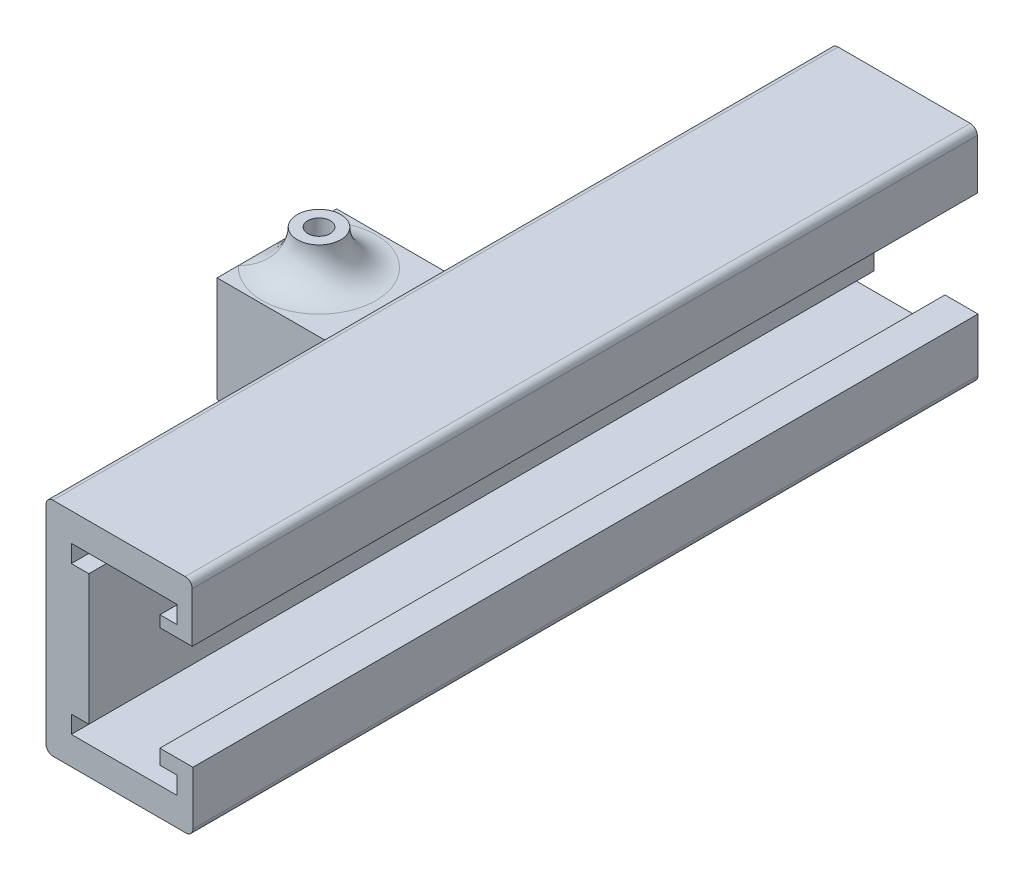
ISO-10303-21;
HEADER;
FILE_DESCRIPTION(('STEP AP214'),'2;1');
FILE_NAME('part.step','',(''),(''),'','','');
FILE_SCHEMA(('AUTOMOTIVE_DESIGN { 1 0 10303 214 1 1 1 1 }'));
ENDSEC;
DATA;
#1=APPLICATION_CONTEXT('core data for automotive mechanical design processes');
#2=APPLICATION_PROTOCOL_DEFINITION('international standard','automotive_design',2000,#1);
#3=PRODUCT_CONTEXT('',#1,'mechanical');
#4=PRODUCT('Part','Part','',(#3));
#5=PRODUCT_RELATED_PRODUCT_CATEGORY('part','',(#4));
#6=PRODUCT_DEFINITION_FORMATION('','',#4);
#7=PRODUCT_DEFINITION_CONTEXT('part definition',#1,'design');
#8=PRODUCT_DEFINITION('design','',#6,#7);
#9=PRODUCT_DEFINITION_SHAPE('','',#8);
#10=(LENGTH_UNIT() NAMED_UNIT(*) SI_UNIT(.MILLI.,.METRE.));
#11=(NAMED_UNIT(*) PLANE_ANGLE_UNIT() SI_UNIT($,.RADIAN.));
#12=(NAMED_UNIT(*) SI_UNIT($,.STERADIAN.) SOLID_ANGLE_UNIT());
#13=UNCERTAINTY_MEASURE_WITH_UNIT(LENGTH_MEASURE(1.E-05),#10,'distance_accuracy_value','');
#14=(GEOMETRIC_REPRESENTATION_CONTEXT(3) GLOBAL_UNCERTAINTY_ASSIGNED_CONTEXT((#13)) GLOBAL_UNIT_ASSIGNED_CONTEXT((#10,
#11,#12)) REPRESENTATION_CONTEXT('',''));
#15=CARTESIAN_POINT('',(0.,0.,0.));
#16=DIRECTION('',(0.,0.,1.));
#17=DIRECTION('',(1.,0.,0.));
#18=AXIS2_PLACEMENT_3D('',#15,#16,#17);
#19=CARTESIAN_POINT('',(-43.65,-22.755,54.));
#20=DIRECTION('',(0.,1.,0.));
#21=DIRECTION('',(-1.,0.,0.));
#22=AXIS2_PLACEMENT_3D('',#19,#20,#21);
#23=PLANE('',#22);
#24=DIRECTION('',(1.,0.,0.));
#25=VECTOR('',#24,1.);
#26=CARTESIAN_POINT('',(-43.65,-22.755,73.5));
#27=LINE('',#26,#25);
#28=CARTESIAN_POINT('',(-43.65,-22.755,73.5));
#29=VERTEX_POINT('',#28);
#30=CARTESIAN_POINT('',(-9.15000000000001,-22.755,73.5));
#31=VERTEX_POINT('',#30);
#32=EDGE_CURVE('E590',#29,#31,#27,.T.);
#33=ORIENTED_EDGE('',*,*,#32,.T.);
#34=DIRECTION('',(0.,0.,-1.));
#35=VECTOR('',#34,1.);
#36=CARTESIAN_POINT('',(-9.15000000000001,-22.755,54.));
#37=LINE('',#36,#35);
#38=CARTESIAN_POINT('',(-9.15000000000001,-22.755,54.));
#39=VERTEX_POINT('',#38);
#40=EDGE_CURVE('E550',#31,#39,#37,.T.);
#41=ORIENTED_EDGE('',*,*,#40,.T.);
#42=DIRECTION('',(1.,0.,0.));
#43=VECTOR('',#42,1.);
#44=CARTESIAN_POINT('',(-43.65,-22.755,54.));
#45=LINE('',#44,#43);
#46=CARTESIAN_POINT('',(-43.65,-22.755,54.));
#47=VERTEX_POINT('',#46);
#48=EDGE_CURVE('E578',#47,#39,#45,.T.);
#49=ORIENTED_EDGE('',*,*,#48,.F.);
#50=DIRECTION('',(0.,0.,1.));
#51=VECTOR('',#50,1.);
#52=CARTESIAN_POINT('',(-43.65,-22.755,54.));
#53=LINE('',#52,#51);
#54=EDGE_CURVE('E565',#47,#29,#53,.T.);
#55=ORIENTED_EDGE('',*,*,#54,.T.);
#56=EDGE_LOOP('',(#33,#41,#49,#55));
#57=FACE_BOUND('',#56,.T.);
#58=ADVANCED_FACE('F59',(#57),#23,.T.);
#59=CARTESIAN_POINT('',(-43.65,-22.755,73.5));
#60=DIRECTION('',(0.,0.,-1.));
#61=DIRECTION('',(-1.,0.,0.));
#62=AXIS2_PLACEMENT_3D('',#59,#60,#61);
#63=PLANE('',#62);
#64=DIRECTION('',(1.,0.,0.));
#65=VECTOR('',#64,1.);
#66=CARTESIAN_POINT('',(-43.65,-6.255,73.5));
#67=LINE('',#66,#65);
#68=CARTESIAN_POINT('',(-43.65,-6.255,73.5));
#69=VERTEX_POINT('',#68);
#70=CARTESIAN_POINT('',(-9.15,-6.255,73.5));
#71=VERTEX_POINT('',#70);
#72=EDGE_CURVE('E586',#69,#71,#67,.T.);
#73=ORIENTED_EDGE('',*,*,#72,.T.);
#74=DIRECTION('',(0.,-1.,0.));
#75=VECTOR('',#74,1.);
#76=CARTESIAN_POINT('',(-9.15000000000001,-22.755,73.5));
#77=LINE('',#76,#75);
#78=EDGE_CURVE('E546',#71,#31,#77,.T.);
#79=ORIENTED_EDGE('',*,*,#78,.T.);
#80=ORIENTED_EDGE('',*,*,#32,.F.);
#81=DIRECTION('',(0.,1.,0.));
#82=VECTOR('',#81,1.);
#83=CARTESIAN_POINT('',(-43.65,-22.755,73.5));
#84=LINE('',#83,#82);
#85=EDGE_CURVE('E568',#29,#69,#84,.T.);
#86=ORIENTED_EDGE('',*,*,#85,.T.);
#87=EDGE_LOOP('',(#73,#79,#80,#86));
#88=FACE_BOUND('',#87,.T.);
#89=ADVANCED_FACE('F797',(#88),#63,.T.);
#90=CARTESIAN_POINT('',(-43.65,-6.255,54.));
#91=DIRECTION('',(0.,-1.,0.));
#92=DIRECTION('',(1.,0.,0.));
#93=AXIS2_PLACEMENT_3D('',#90,#91,#92);
#94=PLANE('',#93);
#95=CARTESIAN_POINT('',(-34.65,-6.255,63.75));
#96=DIRECTION('',(0.,-1.,0.));
#97=DIRECTION('',(1.,0.,0.));
#98=AXIS2_PLACEMENT_3D('',#95,#96,#97);
#99=CIRCLE('',#98,2.4);
#100=CARTESIAN_POINT('',(-32.25,-6.255,63.75));
#101=VERTEX_POINT('',#100);
#102=EDGE_CURVE('E560',#101,#101,#99,.T.);
#103=ORIENTED_EDGE('',*,*,#102,.F.);
#104=EDGE_LOOP('',(#103));
#105=FACE_BOUND('',#104,.T.);
#106=DIRECTION('',(1.,0.,0.));
#107=VECTOR('',#106,1.);
#108=CARTESIAN_POINT('',(-43.65,-6.255,54.));
#109=LINE('',#108,#107);
#110=CARTESIAN_POINT('',(-43.65,-6.255,54.));
#111=VERTEX_POINT('',#110);
#112=CARTESIAN_POINT('',(-9.15000000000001,-6.255,54.));
#113=VERTEX_POINT('',#112);
#114=EDGE_CURVE('E582',#111,#113,#109,.T.);
#115=ORIENTED_EDGE('',*,*,#114,.T.);
#116=DIRECTION('',(0.,0.,1.));
#117=VECTOR('',#116,1.);
#118=CARTESIAN_POINT('',(-9.15,-6.255,54.));
#119=LINE('',#118,#117);
#120=EDGE_CURVE('E76',#113,#71,#119,.T.);
#121=ORIENTED_EDGE('',*,*,#120,.T.);
#122=ORIENTED_EDGE('',*,*,#72,.F.);
#123=DIRECTION('',(0.,0.,-1.));
#124=VECTOR('',#123,1.);
#125=CARTESIAN_POINT('',(-43.65,-6.255,54.));
#126=LINE('',#125,#124);
#127=EDGE_CURVE('E571',#69,#111,#126,.T.);
#128=ORIENTED_EDGE('',*,*,#127,.T.);
#129=EDGE_LOOP('',(#115,#121,#122,#128));
#130=FACE_BOUND('',#129,.T.);
#131=ADVANCED_FACE('F803',(#105,#130),#94,.T.);
#132=CARTESIAN_POINT('',(-43.65,-22.755,54.));
#133=DIRECTION('',(0.,0.,1.));
#134=DIRECTION('',(1.,0.,0.));
#135=AXIS2_PLACEMENT_3D('',#132,#133,#134);
#136=PLANE('',#135);
#137=ORIENTED_EDGE('',*,*,#48,.T.);
#138=DIRECTION('',(0.,1.,0.));
#139=VECTOR('',#138,1.);
#140=CARTESIAN_POINT('',(-9.15000000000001,-22.755,54.));
#141=LINE('',#140,#139);
#142=EDGE_CURVE('E541',#39,#113,#141,.T.);
#143=ORIENTED_EDGE('',*,*,#142,.T.);
#144=ORIENTED_EDGE('',*,*,#114,.F.);
#145=DIRECTION('',(0.,-1.,0.));
#146=VECTOR('',#145,1.);
#147=CARTESIAN_POINT('',(-43.65,-22.755,54.));
#148=LINE('',#147,#146);
#149=EDGE_CURVE('E575',#111,#47,#148,.T.);
#150=ORIENTED_EDGE('',*,*,#149,.T.);
#151=EDGE_LOOP('',(#137,#143,#144,#150));
#152=FACE_BOUND('',#151,.T.);
#153=ADVANCED_FACE('F970',(#152),#136,.T.);
#154=CARTESIAN_POINT('',(-13.65,-25.755,43.5));
#155=DIRECTION('',(0.,1.,0.));
#156=DIRECTION('',(-1.,0.,0.));
#157=AXIS2_PLACEMENT_3D('',#154,#155,#156);
#158=CYLINDRICAL_SURFACE('',#157,7.5);
#159=DIRECTION('',(0.,1.,0.));
#160=VECTOR('',#159,1.);
#161=CARTESIAN_POINT('',(-9.15000000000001,-25.755,49.5));
#162=LINE('',#161,#160);
#163=CARTESIAN_POINT('',(-9.15000000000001,-27.255,49.5));
#164=VERTEX_POINT('',#163);
#165=CARTESIAN_POINT('',(-9.15,-1.755,49.5));
#166=VERTEX_POINT('',#165);
#167=EDGE_CURVE('E84',#164,#166,#162,.T.);
#168=ORIENTED_EDGE('',*,*,#167,.F.);
#169=CARTESIAN_POINT('',(-13.65,-33.255,43.5));
#170=DIRECTION('',(0.,0.707106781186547,-0.707106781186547));
#171=DIRECTION('',(0.,0.707106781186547,0.707106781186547));
#172=AXIS2_PLACEMENT_3D('',#169,#170,#171);
#173=ELLIPSE('',#172,10.6066017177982,7.5);
#174=CARTESIAN_POINT('',(-13.65,-25.755,51.));
#175=VERTEX_POINT('',#174);
#176=EDGE_CURVE('E754',#175,#164,#173,.T.);
#177=ORIENTED_EDGE('',*,*,#176,.F.);
#178=DIRECTION('',(0.,-1.,0.));
#179=VECTOR('',#178,1.);
#180=CARTESIAN_POINT('',(-13.65,-25.755,51.));
#181=LINE('',#180,#179);
#182=CARTESIAN_POINT('',(-13.65,-3.255,51.));
#183=VERTEX_POINT('',#182);
#184=EDGE_CURVE('E740',#183,#175,#181,.T.);
#185=ORIENTED_EDGE('',*,*,#184,.F.);
#186=CARTESIAN_POINT('',(-13.65,4.245,43.5));
#187=DIRECTION('',(0.,0.707106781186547,0.707106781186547));
#188=DIRECTION('',(0.,-0.707106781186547,0.707106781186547));
#189=AXIS2_PLACEMENT_3D('',#186,#187,#188);
#190=ELLIPSE('',#189,10.6066017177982,7.5);
#191=EDGE_CURVE('E751',#166,#183,#190,.F.);
#192=ORIENTED_EDGE('',*,*,#191,.F.);
#193=EDGE_LOOP('',(#168,#177,#185,#192));
#194=FACE_BOUND('',#193,.T.);
#195=ADVANCED_FACE('F61',(#194),#158,.F.);
#196=CARTESIAN_POINT('',(-13.65,-33.255,51.));
#197=DIRECTION('',(0.,0.,-1.));
#198=DIRECTION('',(-1.,0.,0.));
#199=AXIS2_PLACEMENT_3D('',#196,#197,#198);
#200=CYLINDRICAL_SURFACE('',#199,7.5);
#201=DIRECTION('',(0.,0.,-1.));
#202=VECTOR('',#201,1.);
#203=CARTESIAN_POINT('',(-9.15000000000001,-27.255,51.));
#204=LINE('',#203,#202);
#205=CARTESIAN_POINT('',(-9.15000000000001,-27.255,78.));
#206=VERTEX_POINT('',#205);
#207=EDGE_CURVE('E535',#206,#164,#204,.T.);
#208=ORIENTED_EDGE('',*,*,#207,.F.);
#209=CARTESIAN_POINT('',(-13.65,-33.255,84.));
#210=DIRECTION('',(0.,-0.707106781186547,-0.707106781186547));
#211=DIRECTION('',(0.,0.707106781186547,-0.707106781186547));
#212=AXIS2_PLACEMENT_3D('',#209,#210,#211);
#213=ELLIPSE('',#212,10.6066017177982,7.5);
#214=CARTESIAN_POINT('',(-13.65,-25.755,76.5));
#215=VERTEX_POINT('',#214);
#216=EDGE_CURVE('E748',#215,#206,#213,.T.);
#217=ORIENTED_EDGE('',*,*,#216,.F.);
#218=DIRECTION('',(0.,0.,1.));
#219=VECTOR('',#218,1.);
#220=CARTESIAN_POINT('',(-13.65,-25.755,76.5));
#221=LINE('',#220,#219);
#222=EDGE_CURVE('E737',#175,#215,#221,.T.);
#223=ORIENTED_EDGE('',*,*,#222,.F.);
#224=ORIENTED_EDGE('',*,*,#176,.T.);
#225=EDGE_LOOP('',(#208,#217,#223,#224));
#226=FACE_BOUND('',#225,.T.);
#227=ADVANCED_FACE('F976',(#226),#200,.F.);
#228=CARTESIAN_POINT('',(-13.65,4.245,51.));
#229=DIRECTION('',(0.,0.,1.));
#230=DIRECTION('',(1.,0.,0.));
#231=AXIS2_PLACEMENT_3D('',#228,#229,#230);
#232=CYLINDRICAL_SURFACE('',#231,7.5);
#233=DIRECTION('',(0.,0.,1.));
#234=VECTOR('',#233,1.);
#235=CARTESIAN_POINT('',(-9.15,-1.755,51.));
#236=LINE('',#235,#234);
#237=CARTESIAN_POINT('',(-9.15000000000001,-1.75500000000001,78.));
#238=VERTEX_POINT('',#237);
#239=EDGE_CURVE('E530',#166,#238,#236,.T.);
#240=ORIENTED_EDGE('',*,*,#239,.F.);
#241=ORIENTED_EDGE('',*,*,#191,.T.);
#242=DIRECTION('',(0.,0.,-1.));
#243=VECTOR('',#242,1.);
#244=CARTESIAN_POINT('',(-13.65,-3.255,51.));
#245=LINE('',#244,#243);
#246=CARTESIAN_POINT('',(-13.65,-3.255,76.5));
#247=VERTEX_POINT('',#246);
#248=EDGE_CURVE('E69',#247,#183,#245,.T.);
#249=ORIENTED_EDGE('',*,*,#248,.F.);
#250=CARTESIAN_POINT('',(-13.65,4.245,84.));
#251=DIRECTION('',(0.,-0.707106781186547,0.707106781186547));
#252=DIRECTION('',(0.,0.707106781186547,0.707106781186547));
#253=AXIS2_PLACEMENT_3D('',#250,#251,#252);
#254=ELLIPSE('',#253,10.6066017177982,7.5);
#255=EDGE_CURVE('E554',#238,#247,#254,.F.);
#256=ORIENTED_EDGE('',*,*,#255,.F.);
#257=EDGE_LOOP('',(#240,#241,#249,#256));
#258=FACE_BOUND('',#257,.T.);
#259=ADVANCED_FACE('F1433',(#258),#232,.F.);
#260=CARTESIAN_POINT('',(-13.65,-25.755,84.));
#261=DIRECTION('',(0.,-1.,0.));
#262=DIRECTION('',(1.,0.,0.));
#263=AXIS2_PLACEMENT_3D('',#260,#261,#262);
#264=CYLINDRICAL_SURFACE('',#263,7.5);
#265=DIRECTION('',(0.,-1.,0.));
#266=VECTOR('',#265,1.);
#267=CARTESIAN_POINT('',(-9.15000000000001,-25.755,78.));
#268=LINE('',#267,#266);
#269=EDGE_CURVE('E13',#238,#206,#268,.T.);
#270=ORIENTED_EDGE('',*,*,#269,.F.);
#271=ORIENTED_EDGE('',*,*,#255,.T.);
#272=DIRECTION('',(0.,1.,0.));
#273=VECTOR('',#272,1.);
#274=CARTESIAN_POINT('',(-13.65,-3.255,76.5));
#275=LINE('',#274,#273);
#276=EDGE_CURVE('E731',#215,#247,#275,.T.);
#277=ORIENTED_EDGE('',*,*,#276,.F.);
#278=ORIENTED_EDGE('',*,*,#216,.T.);
#279=EDGE_LOOP('',(#270,#271,#277,#278));
#280=FACE_BOUND('',#279,.T.);
#281=ADVANCED_FACE('F721',(#280),#264,.F.);
#282=CARTESIAN_POINT('',(-43.65,0.,0.));
#283=DIRECTION('',(1.,0.,0.));
#284=DIRECTION('',(0.,1.,0.));
#285=AXIS2_PLACEMENT_3D('',#282,#283,#284);
#286=PLANE('',#285);
#287=DIRECTION('',(0.,-1.,0.));
#288=VECTOR('',#287,1.);
#289=CARTESIAN_POINT('',(-43.65,-25.755,51.));
#290=LINE('',#289,#288);
#291=CARTESIAN_POINT('',(-43.65,-3.255,51.));
#292=VERTEX_POINT('',#291);
#293=CARTESIAN_POINT('',(-43.65,-25.755,51.));
#294=VERTEX_POINT('',#293);
#295=EDGE_CURVE('E594',#292,#294,#290,.T.);
#296=ORIENTED_EDGE('',*,*,#295,.T.);
#297=DIRECTION('',(0.,0.,1.));
#298=VECTOR('',#297,1.);
#299=CARTESIAN_POINT('',(-43.65,-25.755,51.));
#300=LINE('',#299,#298);
#301=CARTESIAN_POINT('',(-43.65,-25.755,76.5));
#302=VERTEX_POINT('',#301);
#303=EDGE_CURVE('E598',#294,#302,#300,.T.);
#304=ORIENTED_EDGE('',*,*,#303,.T.);
#305=DIRECTION('',(0.,1.,0.));
#306=VECTOR('',#305,1.);
#307=CARTESIAN_POINT('',(-43.65,-25.755,76.5));
#308=LINE('',#307,#306);
#309=CARTESIAN_POINT('',(-43.65,-3.255,76.5));
#310=VERTEX_POINT('',#309);
#311=EDGE_CURVE('E601',#302,#310,#308,.T.);
#312=ORIENTED_EDGE('',*,*,#311,.T.);
#313=DIRECTION('',(0.,0.,-1.));
#314=VECTOR('',#313,1.);
#315=CARTESIAN_POINT('',(-43.65,-3.255,51.));
#316=LINE('',#315,#314);
#317=CARTESIAN_POINT('',(-43.65,-3.255,71.9122607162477));
#318=VERTEX_POINT('',#317);
#319=EDGE_CURVE('E605',#310,#318,#316,.T.);
#320=ORIENTED_EDGE('',*,*,#319,.T.);
#321=CARTESIAN_POINT('',(-43.65,-3.255,55.5877392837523));
#322=VERTEX_POINT('',#321);
#323=EDGE_CURVE('E610',#318,#322,#316,.T.);
#324=ORIENTED_EDGE('',*,*,#323,.T.);
#325=EDGE_CURVE('E604',#322,#292,#316,.T.);
#326=ORIENTED_EDGE('',*,*,#325,.T.);
#327=EDGE_LOOP('',(#296,#304,#312,#320,#324,#326));
#328=FACE_BOUND('',#327,.T.);
#329=ORIENTED_EDGE('',*,*,#54,.F.);
#330=ORIENTED_EDGE('',*,*,#149,.F.);
#331=ORIENTED_EDGE('',*,*,#127,.F.);
#332=ORIENTED_EDGE('',*,*,#85,.F.);
#333=EDGE_LOOP('',(#329,#330,#331,#332));
#334=FACE_BOUND('',#333,.T.);
#335=ADVANCED_FACE('F779',(#328,#334),#286,.F.);
#336=CARTESIAN_POINT('',(-43.65,-25.755,51.));
#337=DIRECTION('',(0.,0.,1.));
#338=DIRECTION('',(1.,0.,0.));
#339=AXIS2_PLACEMENT_3D('',#336,#337,#338);
#340=PLANE('',#339);
#341=DIRECTION('',(1.,0.,0.));
#342=VECTOR('',#341,1.);
#343=CARTESIAN_POINT('',(-43.65,-3.255,51.));
#344=LINE('',#343,#342);
#345=EDGE_CURVE('E609',#292,#183,#344,.T.);
#346=ORIENTED_EDGE('',*,*,#345,.T.);
#347=ORIENTED_EDGE('',*,*,#184,.T.);
#348=DIRECTION('',(1.,0.,0.));
#349=VECTOR('',#348,1.);
#350=CARTESIAN_POINT('',(-43.65,-25.755,51.));
#351=LINE('',#350,#349);
#352=EDGE_CURVE('E622',#294,#175,#351,.T.);
#353=ORIENTED_EDGE('',*,*,#352,.F.);
#354=ORIENTED_EDGE('',*,*,#295,.F.);
#355=EDGE_LOOP('',(#346,#347,#353,#354));
#356=FACE_BOUND('',#355,.T.);
#357=ADVANCED_FACE('F809',(#356),#340,.F.);
#358=CARTESIAN_POINT('',(-43.65,-25.755,51.));
#359=DIRECTION('',(0.,1.,0.));
#360=DIRECTION('',(-1.,0.,0.));
#361=AXIS2_PLACEMENT_3D('',#358,#359,#360);
#362=PLANE('',#361);
#363=ORIENTED_EDGE('',*,*,#352,.T.);
#364=ORIENTED_EDGE('',*,*,#222,.T.);
#365=DIRECTION('',(1.,0.,0.));
#366=VECTOR('',#365,1.);
#367=CARTESIAN_POINT('',(-43.65,-25.755,76.5));
#368=LINE('',#367,#366);
#369=EDGE_CURVE('E618',#302,#215,#368,.T.);
#370=ORIENTED_EDGE('',*,*,#369,.F.);
#371=ORIENTED_EDGE('',*,*,#303,.F.);
#372=EDGE_LOOP('',(#363,#364,#370,#371));
#373=FACE_BOUND('',#372,.T.);
#374=ADVANCED_FACE('F816',(#373),#362,.F.);
#375=CARTESIAN_POINT('',(-43.65,-25.755,76.5));
#376=DIRECTION('',(0.,0.,-1.));
#377=DIRECTION('',(-1.,0.,0.));
#378=AXIS2_PLACEMENT_3D('',#375,#376,#377);
#379=PLANE('',#378);
#380=ORIENTED_EDGE('',*,*,#369,.T.);
#381=ORIENTED_EDGE('',*,*,#276,.T.);
#382=DIRECTION('',(1.,0.,0.));
#383=VECTOR('',#382,1.);
#384=CARTESIAN_POINT('',(-43.65,-3.255,76.5));
#385=LINE('',#384,#383);
#386=EDGE_CURVE('E614',#310,#247,#385,.T.);
#387=ORIENTED_EDGE('',*,*,#386,.F.);
#388=ORIENTED_EDGE('',*,*,#311,.F.);
#389=EDGE_LOOP('',(#380,#381,#387,#388));
#390=FACE_BOUND('',#389,.T.);
#391=ADVANCED_FACE('F813',(#390),#379,.F.);
#392=CARTESIAN_POINT('',(-43.65,-3.255,51.));
#393=DIRECTION('',(0.,-1.,0.));
#394=DIRECTION('',(1.,0.,0.));
#395=AXIS2_PLACEMENT_3D('',#392,#393,#394);
#396=PLANE('',#395);
#397=ORIENTED_EDGE('',*,*,#386,.T.);
#398=ORIENTED_EDGE('',*,*,#248,.T.);
#399=ORIENTED_EDGE('',*,*,#345,.F.);
#400=ORIENTED_EDGE('',*,*,#325,.F.);
#401=CARTESIAN_POINT('',(-34.65,-3.255,63.75));
#402=DIRECTION('',(0.,-1.,0.));
#403=DIRECTION('',(1.,0.,0.));
#404=AXIS2_PLACEMENT_3D('',#401,#402,#403);
#405=CIRCLE('',#404,12.15);
#406=EDGE_CURVE('E694',#322,#318,#405,.T.);
#407=ORIENTED_EDGE('',*,*,#406,.T.);
#408=ORIENTED_EDGE('',*,*,#319,.F.);
#409=EDGE_LOOP('',(#397,#398,#399,#400,#407,#408));
#410=FACE_BOUND('',#409,.T.);
#411=ADVANCED_FACE('F775',(#410),#396,.F.);
#412=CARTESIAN_POINT('',(-34.65,4.245,63.75));
#413=DIRECTION('',(0.,1.,0.));
#414=DIRECTION('',(-1.,0.,0.));
#415=AXIS2_PLACEMENT_3D('',#412,#413,#414);
#416=PLANE('',#415);
#417=CARTESIAN_POINT('',(-34.65,4.245,63.75));
#418=DIRECTION('',(0.,1.,0.));
#419=DIRECTION('',(-1.,0.,0.));
#420=AXIS2_PLACEMENT_3D('',#417,#418,#419);
#421=CIRCLE('',#420,4.65);
#422=CARTESIAN_POINT('',(-38.0944444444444,4.245,66.873828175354));
#423=VERTEX_POINT('',#422);
#424=CARTESIAN_POINT('',(-38.0944444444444,4.245,60.626171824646));
#425=VERTEX_POINT('',#424);
#426=EDGE_CURVE('E561',#423,#425,#421,.T.);
#427=ORIENTED_EDGE('',*,*,#426,.T.);
#428=EDGE_CURVE('E559',#425,#423,#421,.T.);
#429=ORIENTED_EDGE('',*,*,#428,.T.);
#430=EDGE_LOOP('',(#427,#429));
#431=FACE_BOUND('',#430,.T.);
#432=CARTESIAN_POINT('',(-34.65,4.245,63.75));
#433=DIRECTION('',(0.,1.,0.));
#434=DIRECTION('',(-1.,0.,0.));
#435=AXIS2_PLACEMENT_3D('',#432,#433,#434);
#436=CIRCLE('',#435,2.4);
#437=CARTESIAN_POINT('',(-37.05,4.245,63.75));
#438=VERTEX_POINT('',#437);
#439=EDGE_CURVE('E555',#438,#438,#436,.T.);
#440=ORIENTED_EDGE('',*,*,#439,.F.);
#441=EDGE_LOOP('',(#440));
#442=FACE_BOUND('',#441,.T.);
#443=ADVANCED_FACE('F785',(#431,#442),#416,.T.);
#444=CARTESIAN_POINT('',(-34.65,4.245,63.75));
#445=DIRECTION('',(0.,-1.,0.));
#446=DIRECTION('',(1.,0.,0.));
#447=AXIS2_PLACEMENT_3D('',#444,#445,#446);
#448=CYLINDRICAL_SURFACE('',#447,4.65);
#449=ORIENTED_EDGE('',*,*,#428,.F.);
#450=CARTESIAN_POINT('',(-37.243235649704,3.90762958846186,59.8902553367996));
#451=CARTESIAN_POINT('',(-39.0792781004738,-4.67429192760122,61.1238319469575));
#452=CARTESIAN_POINT('',(-43.65,-3.255,53.6648607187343));
#453=CARTESIAN_POINT('',(-37.3002517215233,3.9538945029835,59.928555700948));
#454=CARTESIAN_POINT('',(-38.9608783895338,-4.60732185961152,61.0835791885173));
#455=CARTESIAN_POINT('',(-43.65,-3.255,53.7649358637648));
#456=CARTESIAN_POINT('',(-37.3568272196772,3.99469630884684,59.9684084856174));
#457=CARTESIAN_POINT('',(-38.8523841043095,-4.53256509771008,61.0419643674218));
#458=CARTESIAN_POINT('',(-43.65,-3.255,53.8690673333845));
#459=CARTESIAN_POINT('',(-37.4686926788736,4.06615314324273,60.051041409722));
#460=CARTESIAN_POINT('',(-38.6575947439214,-4.37200335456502,60.960050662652));
#461=CARTESIAN_POINT('',(-43.65,-3.255,54.0849791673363));
#462=CARTESIAN_POINT('',(-37.5239836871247,4.09681672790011,60.093819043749));
#463=CARTESIAN_POINT('',(-38.5711808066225,-4.28641964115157,60.9197890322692));
#464=CARTESIAN_POINT('',(-43.65,-3.255,54.1967529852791));
#465=CARTESIAN_POINT('',(-37.6868372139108,4.17456846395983,60.2258629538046));
#466=CARTESIAN_POINT('',(-38.3483027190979,-4.02165182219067,60.8072568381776));
#467=CARTESIAN_POINT('',(-43.65,-3.255,54.5417709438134));
#468=CARTESIAN_POINT('',(-37.7920481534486,4.20793353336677,60.3192869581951));
#469=CARTESIAN_POINT('',(-38.2432932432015,-3.83164666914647,60.7413578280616));
#470=CARTESIAN_POINT('',(-43.65,-3.255,54.7858788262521));
#471=CARTESIAN_POINT('',(-37.9724617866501,4.24112709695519,60.4948342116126));
#472=CARTESIAN_POINT('',(-38.1263818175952,-3.49243305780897,60.6577603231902));
#473=CARTESIAN_POINT('',(-43.65,-3.255,55.2445668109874));
#474=CARTESIAN_POINT('',(-38.0493035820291,4.24655784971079,60.5751659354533));
#475=CARTESIAN_POINT('',(-38.0987375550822,-3.34395358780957,60.6325233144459));
#476=CARTESIAN_POINT('',(-43.65,-3.255,55.4544658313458));
#477=CARTESIAN_POINT('',(-38.1970331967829,4.24269107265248,60.7411130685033));
#478=CARTESIAN_POINT('',(-38.0818898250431,-3.05752213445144,60.6099774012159));
#479=CARTESIAN_POINT('',(-43.65,-3.255,55.8880696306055));
#480=CARTESIAN_POINT('',(-38.2679186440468,4.23338770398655,60.826730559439));
#481=CARTESIAN_POINT('',(-38.0919780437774,-2.91941797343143,60.6121554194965));
#482=CARTESIAN_POINT('',(-43.65,-3.255,56.1117798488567));
#483=CARTESIAN_POINT('',(-38.4713245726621,4.18859501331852,61.0911481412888));
#484=CARTESIAN_POINT('',(-38.1627288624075,-2.53291282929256,60.6624465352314));
#485=CARTESIAN_POINT('',(-43.65,-3.255,56.802677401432));
#486=CARTESIAN_POINT('',(-38.594144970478,4.13618107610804,61.2770748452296));
#487=CARTESIAN_POINT('',(-38.2624718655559,-2.30389107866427,60.7523484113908));
#488=CARTESIAN_POINT('',(-43.65,-3.255,57.2884858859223));
#489=CARTESIAN_POINT('',(-38.8141545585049,4.01151900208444,61.6682014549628));
#490=CARTESIAN_POINT('',(-38.4971926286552,-1.92193191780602,61.0403393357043));
#491=CARTESIAN_POINT('',(-43.65,-3.255,58.3104618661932));
#492=CARTESIAN_POINT('',(-38.910687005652,3.93884115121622,61.873747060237));
#493=CARTESIAN_POINT('',(-38.6325955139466,-1.76702998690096,61.2383303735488));
#494=CARTESIAN_POINT('',(-43.65,-3.255,58.8475326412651));
#495=CARTESIAN_POINT('',(-39.0323068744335,3.83422640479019,62.190926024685));
#496=CARTESIAN_POINT('',(-38.8212472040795,-1.58564992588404,61.5963913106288));
#497=CARTESIAN_POINT('',(-43.65,-3.255,59.6762905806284));
#498=CARTESIAN_POINT('',(-39.0689834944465,3.80008875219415,62.2981282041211));
#499=CARTESIAN_POINT('',(-38.8814272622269,-1.53373390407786,61.724802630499));
#500=CARTESIAN_POINT('',(-43.65,-3.255,59.9563995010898));
#501=CARTESIAN_POINT('',(-39.1344519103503,3.73598723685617,62.5150822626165));
#502=CARTESIAN_POINT('',(-38.9925923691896,-1.44450347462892,61.9972762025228));
#503=CARTESIAN_POINT('',(-43.65,-3.255,60.5232794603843));
#504=CARTESIAN_POINT('',(-39.1632458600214,3.70602223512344,62.6248334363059));
#505=CARTESIAN_POINT('',(-39.0437920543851,-1.40694316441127,62.1414752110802));
#506=CARTESIAN_POINT('',(-43.65,-3.255,60.8100486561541));
#507=CARTESIAN_POINT('',(-39.2166910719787,3.64848456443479,62.8639312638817));
#508=CARTESIAN_POINT('',(-39.1406896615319,-1.33947408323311,62.4652957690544));
#509=CARTESIAN_POINT('',(-43.65,-3.255,61.4347881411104));
#510=CARTESIAN_POINT('',(-39.2399644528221,3.62204198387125,62.9936290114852));
#511=CARTESIAN_POINT('',(-39.1845890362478,-1.31142921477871,62.6475200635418));
#512=CARTESIAN_POINT('',(-43.65,-3.255,61.7736758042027));
#513=CARTESIAN_POINT('',(-39.2754362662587,3.58095782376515,63.2548161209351));
#514=CARTESIAN_POINT('',(-39.252077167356,-1.26966558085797,63.0215263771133));
#515=CARTESIAN_POINT('',(-43.65,-3.255,62.4561324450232));
#516=CARTESIAN_POINT('',(-39.2876341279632,3.56631685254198,63.3863055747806));
#517=CARTESIAN_POINT('',(-39.2758886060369,-1.25579953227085,63.2138836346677));
#518=CARTESIAN_POINT('',(-43.65,-3.255,62.7997016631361));
#519=CARTESIAN_POINT('',(-39.3007938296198,3.55049742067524,63.6498991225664));
#520=CARTESIAN_POINT('',(-39.3015124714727,-1.24091748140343,63.6016132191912));
#521=CARTESIAN_POINT('',(-43.65,-3.255,63.4884460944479));
#522=CARTESIAN_POINT('',(-39.3017615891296,3.54931186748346,63.7820028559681));
#523=CARTESIAN_POINT('',(-39.3034254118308,-1.23984291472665,63.7976481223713));
#524=CARTESIAN_POINT('',(-43.65,-3.255,63.8336203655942));
#525=CARTESIAN_POINT('',(-39.2924622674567,3.56052432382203,64.045720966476));
#526=CARTESIAN_POINT('',(-39.2852843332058,-1.25032393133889,64.1863651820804));
#527=CARTESIAN_POINT('',(-43.65,-3.255,64.5226902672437));
#528=CARTESIAN_POINT('',(-39.2821958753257,3.57292150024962,64.1773353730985));
#529=CARTESIAN_POINT('',(-39.2651684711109,-1.26191516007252,64.3797191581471));
#530=CARTESIAN_POINT('',(-43.65,-3.255,64.8665859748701));
#531=CARTESIAN_POINT('',(-39.2519536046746,3.60825771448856,64.4274794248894));
#532=CARTESIAN_POINT('',(-39.2073260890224,-1.29718577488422,64.740176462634));
#533=CARTESIAN_POINT('',(-43.65,-3.255,65.5201881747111));
#534=CARTESIAN_POINT('',(-39.2329078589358,3.63017726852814,64.5461446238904));
#535=CARTESIAN_POINT('',(-39.1711269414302,-1.31982586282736,64.9086388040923));
#536=CARTESIAN_POINT('',(-43.65,-3.255,65.830248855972));
#537=CARTESIAN_POINT('',(-39.1857611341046,3.68210177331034,64.7813880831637));
#538=CARTESIAN_POINT('',(-39.084294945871,-1.37815762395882,65.2330376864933));
#539=CARTESIAN_POINT('',(-43.65,-3.255,66.444917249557));
#540=CARTESIAN_POINT('',(-39.1576604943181,3.71210642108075,64.8979664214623));
#541=CARTESIAN_POINT('',(-39.0334393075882,-1.41402338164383,65.389322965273));
#542=CARTESIAN_POINT('',(-43.65,-3.255,66.7495251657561));
#543=CARTESIAN_POINT('',(-39.0925560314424,3.77755319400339,65.1286170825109));
#544=CARTESIAN_POINT('',(-38.9207765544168,-1.50104991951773,65.6853042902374));
#545=CARTESIAN_POINT('',(-43.65,-3.255,67.3521930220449));
#546=CARTESIAN_POINT('',(-39.0555352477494,3.81300563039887,65.2426841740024));
#547=CARTESIAN_POINT('',(-38.8586964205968,-1.55250392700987,65.825171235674));
#548=CARTESIAN_POINT('',(-43.65,-3.255,67.6502392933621));
#549=CARTESIAN_POINT('',(-38.9728187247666,3.88611309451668,65.4675863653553));
#550=CARTESIAN_POINT('',(-38.7285411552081,-1.67311529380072,66.0838445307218));
#551=CARTESIAN_POINT('',(-43.65,-3.255,68.2378869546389));
#552=CARTESIAN_POINT('',(-38.9271183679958,3.92376928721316,65.5784197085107));
#553=CARTESIAN_POINT('',(-38.6602362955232,-1.74264714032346,66.2026687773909));
#554=CARTESIAN_POINT('',(-43.65,-3.255,68.5274837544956));
#555=CARTESIAN_POINT('',(-38.823730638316,4.00033912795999,65.804005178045));
#556=CARTESIAN_POINT('',(-38.5192388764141,-1.90736106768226,66.4227863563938));
#557=CARTESIAN_POINT('',(-43.65,-3.255,69.1169167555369));
#558=CARTESIAN_POINT('',(-38.7654235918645,4.03915299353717,65.9184790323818));
#559=CARTESIAN_POINT('',(-38.4465040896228,-2.00447034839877,66.5219149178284));
#560=CARTESIAN_POINT('',(-43.65,-3.255,69.4160258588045));
#561=CARTESIAN_POINT('',(-38.639400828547,4.11051605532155,66.1424223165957));
#562=CARTESIAN_POINT('',(-38.312008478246,-2.2232242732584,66.6868089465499));
#563=CARTESIAN_POINT('',(-43.65,-3.255,70.0011679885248));
#564=CARTESIAN_POINT('',(-38.5716861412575,4.14306593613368,66.2518922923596));
#565=CARTESIAN_POINT('',(-38.2503307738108,-2.34553138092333,66.7520978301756));
#566=CARTESIAN_POINT('',(-43.65,-3.255,70.2872024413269));
#567=CARTESIAN_POINT('',(-38.4275124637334,4.19675584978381,66.4646526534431));
#568=CARTESIAN_POINT('',(-38.1513949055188,-2.61351414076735,66.8457298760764));
#569=CARTESIAN_POINT('',(-43.65,-3.255,70.8431246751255));
#570=CARTESIAN_POINT('',(-38.3510937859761,4.21794608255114,66.5679684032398));
#571=CARTESIAN_POINT('',(-38.114471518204,-2.75974897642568,66.8735296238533));
#572=CARTESIAN_POINT('',(-43.65,-3.255,71.113078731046));
#573=CARTESIAN_POINT('',(-38.1897943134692,4.24382998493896,66.7680867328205));
#574=CARTESIAN_POINT('',(-38.0803550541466,-3.07147811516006,66.8916243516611));
#575=CARTESIAN_POINT('',(-43.65,-3.255,71.6359685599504));
#576=CARTESIAN_POINT('',(-38.1049175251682,4.24853142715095,66.8648923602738));
#577=CARTESIAN_POINT('',(-38.0840271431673,-3.23743656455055,66.8811007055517));
#578=CARTESIAN_POINT('',(-43.65,-3.255,71.888912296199));
#579=CARTESIAN_POINT('',(-37.9576473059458,4.23804283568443,67.0194329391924));
#580=CARTESIAN_POINT('',(-38.1365991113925,-3.51919688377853,66.8354960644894));
#581=CARTESIAN_POINT('',(-43.65,-3.255,72.2927118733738));
#582=CARTESIAN_POINT('',(-37.8973937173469,4.22905932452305,67.0792821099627));
#583=CARTESIAN_POINT('',(-38.1703172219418,-3.63363210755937,66.8095714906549));
#584=CARTESIAN_POINT('',(-43.65,-3.255,72.4490919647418));
#585=CARTESIAN_POINT('',(-37.7739344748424,4.19985587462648,67.1953896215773));
#586=CARTESIAN_POINT('',(-38.266567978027,-3.86145091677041,66.7453116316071));
#587=CARTESIAN_POINT('',(-43.65,-3.255,72.7524696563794));
#588=CARTESIAN_POINT('',(-37.7107302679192,4.17964139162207,67.2516496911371));
#589=CARTESIAN_POINT('',(-38.3294687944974,-3.97472692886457,66.7068270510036));
#590=CARTESIAN_POINT('',(-43.65,-3.255,72.8994717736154));
#591=CARTESIAN_POINT('',(-37.5812761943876,4.12616651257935,67.3607239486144));
#592=CARTESIAN_POINT('',(-38.4876707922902,-4.19506838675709,66.6209839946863));
#593=CARTESIAN_POINT('',(-43.65,-3.255,73.1844722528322));
#594=CARTESIAN_POINT('',(-37.515005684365,4.09280101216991,67.4135062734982));
#595=CARTESIAN_POINT('',(-38.5835692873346,-4.30181867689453,66.5734959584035));
#596=CARTESIAN_POINT('',(-43.65,-3.255,73.3223873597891));
#597=CARTESIAN_POINT('',(-37.380451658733,4.0115148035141,67.5148756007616));
#598=CARTESIAN_POINT('',(-38.8076235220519,-4.50120330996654,66.4754068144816));
#599=CARTESIAN_POINT('',(-43.65,-3.255,73.5872556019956));
#600=CARTESIAN_POINT('',(-37.3121655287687,3.96357436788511,67.5634568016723));
#601=CARTESIAN_POINT('',(-38.9360307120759,-4.59345787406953,66.4248507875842));
#602=CARTESIAN_POINT('',(-43.65,-3.255,73.7141935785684));
#603=CARTESIAN_POINT('',(-37.2432369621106,3.907630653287,67.6097437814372));
#604=CARTESIAN_POINT('',(-39.0792753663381,-4.67429037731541,66.376168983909));
#605=CARTESIAN_POINT('',(-43.65,-3.255,73.8351369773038));
#606=(BOUNDED_SURFACE() B_SPLINE_SURFACE(3,2,((#450,#451,#452),(#453,#454,#455),(#456,#457,
#458),(#459,#460,#461),(#462,#463,#464),(#465,#466,#467),(#468,#469,#470),(#471,#472,#473),
(#474,#475,#476),(#477,#478,#479),(#480,#481,#482),(#483,#484,#485),(#486,#487,#488),(#489,#490,
#491),(#492,#493,#494),(#495,#496,#497),(#498,#499,#500),(#501,#502,#503),(#504,#505,#506),
(#507,#508,#509),(#510,#511,#512),(#513,#514,#515),(#516,#517,#518),(#519,#520,#521),(#522,#523,
#524),(#525,#526,#527),(#528,#529,#530),(#531,#532,#533),(#534,#535,#536),(#537,#538,#539),
(#540,#541,#542),(#543,#544,#545),(#546,#547,#548),(#549,#550,#551),(#552,#553,#554),(#555,#556,
#557),(#558,#559,#560),(#561,#562,#563),(#564,#565,#566),(#567,#568,#569),(#570,#571,#572),
(#573,#574,#575),(#576,#577,#578),(#579,#580,#581),(#582,#583,#584),(#585,#586,#587),(#588,#589,
#590),(#591,#592,#593),(#594,#595,#596),(#597,#598,#599),(#600,#601,#602),(#603,#604,#605)),
.UNSPECIFIED.,.F.,.F.,.F.) B_SPLINE_SURFACE_WITH_KNOTS((4,2,2,2,2,2,2,2,2,2,2,2,2,2,2,2,2,2,2,2,
2,2,2,2,2,4),(3,3),(0.,0.555712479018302,1.11095476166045,2.21500867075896,3.08545469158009,
3.95624573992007,5.70269013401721,7.48942851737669,8.38278328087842,9.27589370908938,
10.3104205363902,11.345000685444,12.3790354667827,13.4130068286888,14.3563304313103,
15.2996186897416,16.244714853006,17.1903152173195,18.202876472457,19.215326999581,
20.2232656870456,21.2307291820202,21.8964450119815,22.5618377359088,23.2326598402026,
23.9043939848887),(0.,1.),
.UNSPECIFIED.) GEOMETRIC_REPRESENTATION_ITEM() RATIONAL_B_SPLINE_SURFACE(((1.,0.645994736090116,
1.),(1.,0.648872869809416,1.),(1.,0.651995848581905,1.),(1.,0.658650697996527,1.),(1.,
0.662182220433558,1.),(1.,0.673233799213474,1.),(1.,0.68124600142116,1.),(1.,0.696148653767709,
1.),(1.,0.70291774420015,1.),(1.,0.716571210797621,1.),(1.,0.723455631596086,1.),(1.,
0.743937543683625,1.),(1.,0.75732407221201,1.),(1.,0.782282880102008,1.),(1.,0.793806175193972,
1.),(1.,0.80865901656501,1.),(1.,0.813204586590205,1.),(1.,0.821394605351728,1.),(1.,
0.825039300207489,1.),(1.,0.831846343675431,1.),(1.,0.834840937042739,1.),(1.,0.839421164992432,
1.),(1.,0.841006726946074,1.),(1.,0.842717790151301,1.),(1.,0.842844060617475,1.),(1.,
0.841634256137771,1.),(1.,0.840298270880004,1.),(1.,0.836386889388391,1.),(1.,0.833930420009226,
1.),(1.,0.827899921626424,1.),(1.,0.824325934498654,1.),(1.,0.816140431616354,1.),(1.,
0.811526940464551,1.),(1.,0.801375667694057,1.),(1.,0.795837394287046,1.),(1.,0.783555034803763,
1.),(1.,0.776753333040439,1.),(1.,0.762459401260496,1.),(1.,0.754967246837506,1.),(1.,
0.739592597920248,1.),(1.,0.731711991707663,1.),(1.,0.715865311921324,1.),(1.,0.707899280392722,
1.),(1.,0.69494458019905,1.),(1.,0.689862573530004,1.),(1.,0.679980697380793,1.),(1.,
0.675180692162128,1.),(1.,0.665968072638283,1.),(1.,0.661558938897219,1.),(1.,0.653310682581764,
1.),(1.,0.649472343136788,1.),(1.,0.645994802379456,1.))) REPRESENTATION_ITEM('') SURFACE());
#607=CARTESIAN_POINT('',(-37.243235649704,3.90762958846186,59.8902553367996));
#608=CARTESIAN_POINT('',(-37.3002517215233,3.9538945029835,59.928555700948));
#609=CARTESIAN_POINT('',(-37.3568272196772,3.99469630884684,59.9684084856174));
#610=CARTESIAN_POINT('',(-37.4686926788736,4.06615314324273,60.051041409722));
#611=CARTESIAN_POINT('',(-37.5239836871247,4.09681672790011,60.093819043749));
#612=CARTESIAN_POINT('',(-37.6868372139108,4.17456846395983,60.2258629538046));
#613=CARTESIAN_POINT('',(-37.7920481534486,4.20793353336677,60.3192869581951));
#614=CARTESIAN_POINT('',(-37.9724617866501,4.24112709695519,60.4948342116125));
#615=CARTESIAN_POINT('',(-38.049303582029,4.24655784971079,60.5751659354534));
#616=CARTESIAN_POINT('',(-38.1970331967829,4.24269107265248,60.7411130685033));
#617=CARTESIAN_POINT('',(-38.2679186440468,4.23338770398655,60.826730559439));
#618=CARTESIAN_POINT('',(-38.4713245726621,4.18859501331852,61.0911481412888));
#619=CARTESIAN_POINT('',(-38.594144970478,4.13618107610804,61.2770748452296));
#620=CARTESIAN_POINT('',(-38.8141545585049,4.01151900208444,61.6682014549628));
#621=CARTESIAN_POINT('',(-38.910687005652,3.93884115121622,61.8737470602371));
#622=CARTESIAN_POINT('',(-39.0323068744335,3.83422640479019,62.1909260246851));
#623=CARTESIAN_POINT('',(-39.0689834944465,3.80008875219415,62.2981282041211));
#624=CARTESIAN_POINT('',(-39.1344519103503,3.73598723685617,62.5150822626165));
#625=CARTESIAN_POINT('',(-39.1632458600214,3.70602223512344,62.6248334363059));
#626=CARTESIAN_POINT('',(-39.2166910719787,3.64848456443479,62.8639312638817));
#627=CARTESIAN_POINT('',(-39.2399644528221,3.62204198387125,62.9936290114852));
#628=CARTESIAN_POINT('',(-39.2754362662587,3.58095782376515,63.2548161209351));
#629=CARTESIAN_POINT('',(-39.2876341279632,3.56631685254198,63.3863055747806));
#630=CARTESIAN_POINT('',(-39.3007938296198,3.55049742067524,63.6498991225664));
#631=CARTESIAN_POINT('',(-39.3017615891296,3.54931186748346,63.7820028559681));
#632=CARTESIAN_POINT('',(-39.2924622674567,3.56052432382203,64.045720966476));
#633=CARTESIAN_POINT('',(-39.2821958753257,3.57292150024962,64.1773353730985));
#634=CARTESIAN_POINT('',(-39.2519536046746,3.60825771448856,64.4274794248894));
#635=CARTESIAN_POINT('',(-39.2329078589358,3.63017726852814,64.5461446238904));
#636=CARTESIAN_POINT('',(-39.1857611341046,3.68210177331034,64.7813880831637));
#637=CARTESIAN_POINT('',(-39.1576604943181,3.71210642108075,64.8979664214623));
#638=CARTESIAN_POINT('',(-39.0925560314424,3.77755319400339,65.1286170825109));
#639=CARTESIAN_POINT('',(-39.0555352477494,3.81300563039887,65.2426841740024));
#640=CARTESIAN_POINT('',(-38.9728187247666,3.88611309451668,65.4675863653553));
#641=CARTESIAN_POINT('',(-38.9271183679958,3.92376928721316,65.5784197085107));
#642=CARTESIAN_POINT('',(-38.823730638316,4.00033912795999,65.804005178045));
#643=CARTESIAN_POINT('',(-38.7654235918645,4.03915299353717,65.9184790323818));
#644=CARTESIAN_POINT('',(-38.639400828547,4.11051605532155,66.1424223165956));
#645=CARTESIAN_POINT('',(-38.5716861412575,4.14306593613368,66.2518922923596));
#646=CARTESIAN_POINT('',(-38.4275124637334,4.19675584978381,66.4646526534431));
#647=CARTESIAN_POINT('',(-38.351093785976,4.21794608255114,66.5679684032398));
#648=CARTESIAN_POINT('',(-38.1897943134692,4.24382998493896,66.7680867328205));
#649=CARTESIAN_POINT('',(-38.1049175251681,4.24853142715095,66.8648923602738));
#650=CARTESIAN_POINT('',(-37.9576473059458,4.23804283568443,67.0194329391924));
#651=CARTESIAN_POINT('',(-37.8973937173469,4.22905932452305,67.0792821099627));
#652=CARTESIAN_POINT('',(-37.7739344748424,4.19985587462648,67.1953896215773));
#653=CARTESIAN_POINT('',(-37.7107302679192,4.17964139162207,67.2516496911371));
#654=CARTESIAN_POINT('',(-37.5812761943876,4.12616651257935,67.3607239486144));
#655=CARTESIAN_POINT('',(-37.515005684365,4.0928010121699,67.4135062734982));
#656=CARTESIAN_POINT('',(-37.380451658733,4.0115148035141,67.5148756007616));
#657=CARTESIAN_POINT('',(-37.3121655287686,3.96357436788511,67.5634568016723));
#658=CARTESIAN_POINT('',(-37.2432369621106,3.907630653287,67.6097437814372));
#659=B_SPLINE_CURVE_WITH_KNOTS('',3,(#607,#608,#609,#610,#611,#612,#613,#614,#615,#616,#617,
#618,#619,#620,#621,#622,#623,#624,#625,#626,#627,#628,#629,#630,#631,#632,#633,#634,#635,#636,
#637,#638,#639,#640,#641,#642,#643,#644,#645,#646,#647,#648,#649,#650,#651,#652,#653,#654,#655,
#656,#657,#658),.UNSPECIFIED.,.F.,.F.,(4,2,2,2,2,2,2,2,2,2,2,2,2,2,2,2,2,2,2,2,2,2,2,2,2,4),(0.,
0.555712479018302,1.11095476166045,2.21500867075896,3.08545469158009,3.95624573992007,
5.70269013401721,7.48942851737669,8.38278328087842,9.27589370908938,10.3104205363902,
11.345000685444,12.3790354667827,13.4130068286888,14.3563304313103,15.2996186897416,
16.244714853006,17.1903152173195,18.202876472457,19.215326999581,20.2232656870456,
21.2307291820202,21.8964450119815,22.5618377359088,23.2326598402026,23.9043939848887),.UNSPECIFIED.);
#660=EDGE_CURVE('E677',#425,#423,#659,.T.);
#661=ORIENTED_EDGE('',*,*,#660,.T.);
#662=EDGE_LOOP('',(#449,#661));
#663=FACE_BOUND('',#662,.T.);
#664=ADVANCED_FACE('F696',(#663),#448,.T.);
#665=CARTESIAN_POINT('',(-34.65,4.245,63.75));
#666=DIRECTION('',(0.,-1.,0.));
#667=DIRECTION('',(1.,0.,0.));
#668=AXIS2_PLACEMENT_3D('',#665,#666,#667);
#669=CYLINDRICAL_SURFACE('',#668,2.4);
#670=ORIENTED_EDGE('',*,*,#439,.T.);
#671=EDGE_LOOP('',(#670));
#672=FACE_BOUND('',#671,.T.);
#673=ORIENTED_EDGE('',*,*,#102,.T.);
#674=EDGE_LOOP('',(#673));
#675=FACE_BOUND('',#674,.T.);
#676=ADVANCED_FACE('F789',(#672,#675),#669,.F.);
#677=CARTESIAN_POINT('',(-34.65,4.245,63.75));
#678=DIRECTION('',(0.,-1.,0.));
#679=DIRECTION('',(1.,0.,0.));
#680=AXIS2_PLACEMENT_3D('',#677,#678,#679);
#681=TOROIDAL_SURFACE('',#680,12.15,7.5);
#682=CARTESIAN_POINT('',(-43.65,4.245,71.9122607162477));
#683=DIRECTION('',(0.671791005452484,0.,0.74074074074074));
#684=DIRECTION('',(0.740740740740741,0.,-0.671791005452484));
#685=AXIS2_PLACEMENT_3D('',#682,#683,#684);
#686=CIRCLE('',#685,7.5);
#687=EDGE_CURVE('E756',#318,#423,#686,.T.);
#688=ORIENTED_EDGE('',*,*,#687,.F.);
#689=ORIENTED_EDGE('',*,*,#406,.F.);
#690=CARTESIAN_POINT('',(-43.65,4.245,55.5877392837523));
#691=DIRECTION('',(0.671791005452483,0.,-0.740740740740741));
#692=DIRECTION('',(-0.740740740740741,0.,-0.671791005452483));
#693=AXIS2_PLACEMENT_3D('',#690,#691,#692);
#694=CIRCLE('',#693,7.5);
#695=EDGE_CURVE('E684',#425,#322,#694,.T.);
#696=ORIENTED_EDGE('',*,*,#695,.F.);
#697=ORIENTED_EDGE('',*,*,#426,.F.);
#698=EDGE_LOOP('',(#688,#689,#696,#697));
#699=FACE_BOUND('',#698,.T.);
#700=ADVANCED_FACE('F718',(#699),#681,.F.);
#701=ORIENTED_EDGE('',*,*,#695,.T.);
#702=ORIENTED_EDGE('',*,*,#323,.F.);
#703=ORIENTED_EDGE('',*,*,#687,.T.);
#704=ORIENTED_EDGE('',*,*,#660,.F.);
#705=EDGE_LOOP('',(#701,#702,#703,#704));
#706=FACE_BOUND('',#705,.T.);
#707=ADVANCED_FACE('F711',(#706),#606,.F.);
#708=CARTESIAN_POINT('',(20.7,-36.66,184.254370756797));
#709=DIRECTION('',(0.,0.,-1.));
#710=DIRECTION('',(-1.,0.,0.));
#711=AXIS2_PLACEMENT_3D('',#708,#709,#710);
#712=CYLINDRICAL_SURFACE('',#711,1.5);
#713=DIRECTION('',(0.,0.,-1.));
#714=VECTOR('',#713,1.);
#715=CARTESIAN_POINT('',(22.2,-36.66,184.254370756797));
#716=LINE('',#715,#714);
#717=CARTESIAN_POINT('',(22.2,-36.66,147.5));
#718=VERTEX_POINT('',#717);
#719=CARTESIAN_POINT('',(22.2,-36.66,-20.));
#720=VERTEX_POINT('',#719);
#721=EDGE_CURVE('E528',#718,#720,#716,.T.);
#722=ORIENTED_EDGE('',*,*,#721,.F.);
#723=CARTESIAN_POINT('',(20.7,-36.66,147.5));
#724=DIRECTION('',(0.,0.,1.));
#725=DIRECTION('',(1.,0.,0.));
#726=AXIS2_PLACEMENT_3D('',#723,#724,#725);
#727=CIRCLE('',#726,1.5);
#728=CARTESIAN_POINT('',(20.7,-38.16,147.5));
#729=VERTEX_POINT('',#728);
#730=EDGE_CURVE('E447',#729,#718,#727,.T.);
#731=ORIENTED_EDGE('',*,*,#730,.F.);
#732=DIRECTION('',(0.,0.,-1.));
#733=VECTOR('',#732,1.);
#734=CARTESIAN_POINT('',(20.7,-38.16,184.254370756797));
#735=LINE('',#734,#733);
#736=CARTESIAN_POINT('',(20.7,-38.16,-20.));
#737=VERTEX_POINT('',#736);
#738=EDGE_CURVE('E525',#729,#737,#735,.T.);
#739=ORIENTED_EDGE('',*,*,#738,.T.);
#740=CARTESIAN_POINT('',(20.7,-36.66,-20.));
#741=DIRECTION('',(0.,0.,-1.));
#742=DIRECTION('',(-1.,0.,0.));
#743=AXIS2_PLACEMENT_3D('',#740,#741,#742);
#744=CIRCLE('',#743,1.5);
#745=EDGE_CURVE('E393',#720,#737,#744,.T.);
#746=ORIENTED_EDGE('',*,*,#745,.F.);
#747=EDGE_LOOP('',(#722,#731,#739,#746));
#748=FACE_BOUND('',#747,.T.);
#749=ADVANCED_FACE('F717',(#748),#712,.T.);
#750=CARTESIAN_POINT('',(-7.65000000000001,-38.16,184.254370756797));
#751=DIRECTION('',(0.,1.,0.));
#752=DIRECTION('',(-1.,0.,0.));
#753=AXIS2_PLACEMENT_3D('',#750,#751,#752);
#754=PLANE('',#753);
#755=ORIENTED_EDGE('',*,*,#738,.F.);
#756=DIRECTION('',(1.,0.,0.));
#757=VECTOR('',#756,1.);
#758=CARTESIAN_POINT('',(-7.65000000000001,-38.16,147.5));
#759=LINE('',#758,#757);
#760=CARTESIAN_POINT('',(-7.65000000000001,-38.16,147.5));
#761=VERTEX_POINT('',#760);
#762=EDGE_CURVE('E443',#761,#729,#759,.T.);
#763=ORIENTED_EDGE('',*,*,#762,.F.);
#764=DIRECTION('',(0.,0.,-1.));
#765=VECTOR('',#764,1.);
#766=CARTESIAN_POINT('',(-7.65000000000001,-38.16,184.254370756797));
#767=LINE('',#766,#765);
#768=CARTESIAN_POINT('',(-7.65000000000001,-38.16,-20.));
#769=VERTEX_POINT('',#768);
#770=EDGE_CURVE('E522',#761,#769,#767,.T.);
#771=ORIENTED_EDGE('',*,*,#770,.T.);
#772=DIRECTION('',(-1.,0.,0.));
#773=VECTOR('',#772,1.);
#774=CARTESIAN_POINT('',(20.7,-38.16,-20.));
#775=LINE('',#774,#773);
#776=EDGE_CURVE('E397',#737,#769,#775,.T.);
#777=ORIENTED_EDGE('',*,*,#776,.F.);
#778=EDGE_LOOP('',(#755,#763,#771,#777));
#779=FACE_BOUND('',#778,.T.);
#780=ADVANCED_FACE('F914',(#779),#754,.F.);
#781=CARTESIAN_POINT('',(-7.65000000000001,-36.66,184.254370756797));
#782=DIRECTION('',(0.,0.,-1.));
#783=DIRECTION('',(-1.,0.,0.));
#784=AXIS2_PLACEMENT_3D('',#781,#782,#783);
#785=CYLINDRICAL_SURFACE('',#784,1.5);
#786=ORIENTED_EDGE('',*,*,#770,.F.);
#787=CARTESIAN_POINT('',(-7.65000000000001,-36.66,147.5));
#788=DIRECTION('',(0.,0.,1.));
#789=DIRECTION('',(1.,0.,0.));
#790=AXIS2_PLACEMENT_3D('',#787,#788,#789);
#791=CIRCLE('',#790,1.5);
#792=CARTESIAN_POINT('',(-9.15000000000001,-36.66,147.5));
#793=VERTEX_POINT('',#792);
#794=EDGE_CURVE('E439',#793,#761,#791,.T.);
#795=ORIENTED_EDGE('',*,*,#794,.F.);
#796=DIRECTION('',(0.,0.,-1.));
#797=VECTOR('',#796,1.);
#798=CARTESIAN_POINT('',(-9.15000000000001,-36.66,184.254370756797));
#799=LINE('',#798,#797);
#800=CARTESIAN_POINT('',(-9.15000000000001,-36.66,-20.));
#801=VERTEX_POINT('',#800);
#802=EDGE_CURVE('E519',#793,#801,#799,.T.);
#803=ORIENTED_EDGE('',*,*,#802,.T.);
#804=CARTESIAN_POINT('',(-7.65000000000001,-36.66,-20.));
#805=DIRECTION('',(0.,0.,-1.));
#806=DIRECTION('',(-1.,0.,0.));
#807=AXIS2_PLACEMENT_3D('',#804,#805,#806);
#808=CIRCLE('',#807,1.5);
#809=EDGE_CURVE('E401',#769,#801,#808,.T.);
#810=ORIENTED_EDGE('',*,*,#809,.F.);
#811=EDGE_LOOP('',(#786,#795,#803,#810));
#812=FACE_BOUND('',#811,.T.);
#813=ADVANCED_FACE('F917',(#812),#785,.T.);
#814=CARTESIAN_POINT('',(-7.65,7.65,184.254370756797));
#815=DIRECTION('',(0.,0.,-1.));
#816=DIRECTION('',(-1.,0.,0.));
#817=AXIS2_PLACEMENT_3D('',#814,#815,#816);
#818=CYLINDRICAL_SURFACE('',#817,1.5);
#819=DIRECTION('',(0.,0.,-1.));
#820=VECTOR('',#819,1.);
#821=CARTESIAN_POINT('',(-9.15,7.64999999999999,184.254370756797));
#822=LINE('',#821,#820);
#823=CARTESIAN_POINT('',(-9.15,7.64999999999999,147.5));
#824=VERTEX_POINT('',#823);
#825=CARTESIAN_POINT('',(-9.15,7.64999999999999,-20.));
#826=VERTEX_POINT('',#825);
#827=EDGE_CURVE('E516',#824,#826,#822,.T.);
#828=ORIENTED_EDGE('',*,*,#827,.F.);
#829=CARTESIAN_POINT('',(-7.65,7.65,147.5));
#830=DIRECTION('',(0.,0.,1.));
#831=DIRECTION('',(1.,0.,0.));
#832=AXIS2_PLACEMENT_3D('',#829,#830,#831);
#833=CIRCLE('',#832,1.5);
#834=CARTESIAN_POINT('',(-7.64999999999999,9.15,147.5));
#835=VERTEX_POINT('',#834);
#836=EDGE_CURVE('E431',#835,#824,#833,.T.);
#837=ORIENTED_EDGE('',*,*,#836,.F.);
#838=DIRECTION('',(0.,0.,-1.));
#839=VECTOR('',#838,1.);
#840=CARTESIAN_POINT('',(-7.64999999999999,9.15,184.254370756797));
#841=LINE('',#840,#839);
#842=CARTESIAN_POINT('',(-7.64999999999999,9.15,-20.));
#843=VERTEX_POINT('',#842);
#844=EDGE_CURVE('E513',#835,#843,#841,.T.);
#845=ORIENTED_EDGE('',*,*,#844,.T.);
#846=CARTESIAN_POINT('',(-7.65,7.65,-20.));
#847=DIRECTION('',(0.,0.,-1.));
#848=DIRECTION('',(-1.,0.,0.));
#849=AXIS2_PLACEMENT_3D('',#846,#847,#848);
#850=CIRCLE('',#849,1.5);
#851=EDGE_CURVE('E409',#826,#843,#850,.T.);
#852=ORIENTED_EDGE('',*,*,#851,.F.);
#853=EDGE_LOOP('',(#828,#837,#845,#852));
#854=FACE_BOUND('',#853,.T.);
#855=ADVANCED_FACE('F926',(#854),#818,.T.);
#856=CARTESIAN_POINT('',(20.55,9.15,184.254370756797));
#857=DIRECTION('',(0.,-1.,0.));
#858=DIRECTION('',(0.,0.,-1.));
#859=AXIS2_PLACEMENT_3D('',#856,#857,#858);
#860=PLANE('',#859);
#861=ORIENTED_EDGE('',*,*,#844,.F.);
#862=DIRECTION('',(-1.,0.,0.));
#863=VECTOR('',#862,1.);
#864=CARTESIAN_POINT('',(20.55,9.15,147.5));
#865=LINE('',#864,#863);
#866=CARTESIAN_POINT('',(20.55,9.15,147.5));
#867=VERTEX_POINT('',#866);
#868=EDGE_CURVE('E427',#867,#835,#865,.T.);
#869=ORIENTED_EDGE('',*,*,#868,.F.);
#870=DIRECTION('',(0.,0.,-1.));
#871=VECTOR('',#870,1.);
#872=CARTESIAN_POINT('',(20.55,9.15,184.254370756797));
#873=LINE('',#872,#871);
#874=CARTESIAN_POINT('',(20.55,9.15,-20.));
#875=VERTEX_POINT('',#874);
#876=EDGE_CURVE('E310',#867,#875,#873,.T.);
#877=ORIENTED_EDGE('',*,*,#876,.T.);
#878=DIRECTION('',(1.,0.,0.));
#879=VECTOR('',#878,1.);
#880=CARTESIAN_POINT('',(-7.64999999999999,9.15,-20.));
#881=LINE('',#880,#879);
#882=EDGE_CURVE('E327',#843,#875,#881,.T.);
#883=ORIENTED_EDGE('',*,*,#882,.F.);
#884=EDGE_LOOP('',(#861,#869,#877,#883));
#885=FACE_BOUND('',#884,.T.);
#886=ADVANCED_FACE('F929',(#885),#860,.F.);
#887=CARTESIAN_POINT('',(20.55,7.65,184.254370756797));
#888=DIRECTION('',(0.,0.,-1.));
#889=DIRECTION('',(-1.,0.,0.));
#890=AXIS2_PLACEMENT_3D('',#887,#888,#889);
#891=CYLINDRICAL_SURFACE('',#890,1.5);
#892=ORIENTED_EDGE('',*,*,#876,.F.);
#893=CARTESIAN_POINT('',(20.55,7.65,147.5));
#894=DIRECTION('',(0.,0.,1.));
#895=DIRECTION('',(1.,0.,0.));
#896=AXIS2_PLACEMENT_3D('',#893,#894,#895);
#897=CIRCLE('',#896,1.5);
#898=CARTESIAN_POINT('',(22.05,7.64999999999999,147.5));
#899=VERTEX_POINT('',#898);
#900=EDGE_CURVE('E305',#899,#867,#897,.T.);
#901=ORIENTED_EDGE('',*,*,#900,.F.);
#902=DIRECTION('',(0.,0.,-1.));
#903=VECTOR('',#902,1.);
#904=CARTESIAN_POINT('',(22.05,7.64999999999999,184.254370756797));
#905=LINE('',#904,#903);
#906=CARTESIAN_POINT('',(22.05,7.64999999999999,-20.));
#907=VERTEX_POINT('',#906);
#908=EDGE_CURVE('E299',#899,#907,#905,.T.);
#909=ORIENTED_EDGE('',*,*,#908,.T.);
#910=CARTESIAN_POINT('',(20.55,7.65,-20.));
#911=DIRECTION('',(0.,0.,-1.));
#912=DIRECTION('',(-1.,0.,0.));
#913=AXIS2_PLACEMENT_3D('',#910,#911,#912);
#914=CIRCLE('',#913,1.5);
#915=EDGE_CURVE('E303',#875,#907,#914,.T.);
#916=ORIENTED_EDGE('',*,*,#915,.F.);
#917=EDGE_LOOP('',(#892,#901,#909,#916));
#918=FACE_BOUND('',#917,.T.);
#919=ADVANCED_FACE('F301',(#918),#891,.T.);
#920=CARTESIAN_POINT('',(-9.15,7.64999999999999,184.254370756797));
#921=DIRECTION('',(1.,0.,0.));
#922=DIRECTION('',(0.,1.,0.));
#923=AXIS2_PLACEMENT_3D('',#920,#921,#922);
#924=PLANE('',#923);
#925=ORIENTED_EDGE('',*,*,#802,.F.);
#926=DIRECTION('',(0.,-1.,0.));
#927=VECTOR('',#926,1.);
#928=CARTESIAN_POINT('',(-9.15,7.64999999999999,147.5));
#929=LINE('',#928,#927);
#930=EDGE_CURVE('E435',#824,#793,#929,.T.);
#931=ORIENTED_EDGE('',*,*,#930,.F.);
#932=ORIENTED_EDGE('',*,*,#827,.T.);
#933=DIRECTION('',(0.,1.,0.));
#934=VECTOR('',#933,1.);
#935=CARTESIAN_POINT('',(-9.15000000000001,-36.66,-20.));
#936=LINE('',#935,#934);
#937=EDGE_CURVE('E405',#801,#826,#936,.T.);
#938=ORIENTED_EDGE('',*,*,#937,.F.);
#939=EDGE_LOOP('',(#925,#931,#932,#938));
#940=FACE_BOUND('',#939,.T.);
#941=ORIENTED_EDGE('',*,*,#207,.T.);
#942=ORIENTED_EDGE('',*,*,#167,.T.);
#943=ORIENTED_EDGE('',*,*,#239,.T.);
#944=ORIENTED_EDGE('',*,*,#269,.T.);
#945=EDGE_LOOP('',(#941,#942,#943,#944));
#946=FACE_BOUND('',#945,.T.);
#947=ADVANCED_FACE('F921',(#940,#946),#924,.F.);
#948=CARTESIAN_POINT('',(-9.15000000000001,-13.875,63.75));
#949=DIRECTION('',(1.,0.,0.));
#950=DIRECTION('',(0.,1.,0.));
#951=AXIS2_PLACEMENT_3D('',#948,#949,#950);
#952=CIRCLE('',#951,6.63);
#953=CARTESIAN_POINT('',(-9.15000000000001,-7.24500000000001,63.75));
#954=VERTEX_POINT('',#953);
#955=EDGE_CURVE('E63',#954,#954,#952,.T.);
#956=ORIENTED_EDGE('',*,*,#955,.T.);
#957=EDGE_LOOP('',(#956));
#958=FACE_BOUND('',#957,.T.);
#959=ORIENTED_EDGE('',*,*,#40,.F.);
#960=ORIENTED_EDGE('',*,*,#78,.F.);
#961=ORIENTED_EDGE('',*,*,#120,.F.);
#962=ORIENTED_EDGE('',*,*,#142,.F.);
#963=EDGE_LOOP('',(#959,#960,#961,#962));
#964=FACE_BOUND('',#963,.T.);
#965=ADVANCED_FACE('F879',(#958,#964),#924,.F.);
#966=CARTESIAN_POINT('',(15.15,0.,127.5));
#967=DIRECTION('',(1.,0.,0.));
#968=DIRECTION('',(0.,0.,-1.));
#969=AXIS2_PLACEMENT_3D('',#966,#967,#968);
#970=PLANE('',#969);
#971=DIRECTION('',(0.,0.,-1.));
#972=VECTOR('',#971,1.);
#973=CARTESIAN_POINT('',(15.15,-0.6,127.5));
#974=LINE('',#973,#972);
#975=CARTESIAN_POINT('',(15.15,-0.6,147.5));
#976=VERTEX_POINT('',#975);
#977=CARTESIAN_POINT('',(15.15,-0.6,-20.));
#978=VERTEX_POINT('',#977);
#979=EDGE_CURVE('E666',#976,#978,#974,.T.);
#980=ORIENTED_EDGE('',*,*,#979,.T.);
#981=DIRECTION('',(0.,1.,0.));
#982=VECTOR('',#981,1.);
#983=CARTESIAN_POINT('',(15.15,-3.,-20.));
#984=LINE('',#983,#982);
#985=CARTESIAN_POINT('',(15.15,-3.,-20.));
#986=VERTEX_POINT('',#985);
#987=EDGE_CURVE('E333',#986,#978,#984,.T.);
#988=ORIENTED_EDGE('',*,*,#987,.F.);
#989=DIRECTION('',(0.,0.,1.));
#990=VECTOR('',#989,1.);
#991=CARTESIAN_POINT('',(15.15,-3.,0.));
#992=LINE('',#991,#990);
#993=CARTESIAN_POINT('',(15.15,-3.,147.5));
#994=VERTEX_POINT('',#993);
#995=EDGE_CURVE('E311',#986,#994,#992,.T.);
#996=ORIENTED_EDGE('',*,*,#995,.T.);
#997=DIRECTION('',(0.,-1.,0.));
#998=VECTOR('',#997,1.);
#999=CARTESIAN_POINT('',(15.15,-0.6,147.5));
#1000=LINE('',#999,#998);
#1001=EDGE_CURVE('E414',#976,#994,#1000,.T.);
#1002=ORIENTED_EDGE('',*,*,#1001,.F.);
#1003=EDGE_LOOP('',(#980,#988,#996,#1002));
#1004=FACE_BOUND('',#1003,.T.);
#1005=ADVANCED_FACE('F876',(#1004),#970,.F.);
#1006=CARTESIAN_POINT('',(18.75,-0.6,127.5));
#1007=DIRECTION('',(0.,-1.,0.));
#1008=DIRECTION('',(0.,0.,-1.));
#1009=AXIS2_PLACEMENT_3D('',#1006,#1007,#1008);
#1010=PLANE('',#1009);
#1011=ORIENTED_EDGE('',*,*,#979,.F.);
#1012=DIRECTION('',(-1.,0.,0.));
#1013=VECTOR('',#1012,1.);
#1014=CARTESIAN_POINT('',(18.75,-0.6,147.5));
#1015=LINE('',#1014,#1013);
#1016=CARTESIAN_POINT('',(18.75,-0.6,147.5));
#1017=VERTEX_POINT('',#1016);
#1018=EDGE_CURVE('E503',#1017,#976,#1015,.T.);
#1019=ORIENTED_EDGE('',*,*,#1018,.F.);
#1020=DIRECTION('',(0.,0.,-1.));
#1021=VECTOR('',#1020,1.);
#1022=CARTESIAN_POINT('',(18.75,-0.6,127.5));
#1023=LINE('',#1022,#1021);
#1024=CARTESIAN_POINT('',(18.75,-0.6,-20.));
#1025=VERTEX_POINT('',#1024);
#1026=EDGE_CURVE('E647',#1017,#1025,#1023,.T.);
#1027=ORIENTED_EDGE('',*,*,#1026,.T.);
#1028=DIRECTION('',(1.,0.,0.));
#1029=VECTOR('',#1028,1.);
#1030=CARTESIAN_POINT('',(15.15,-0.6,-20.));
#1031=LINE('',#1030,#1029);
#1032=EDGE_CURVE('E337',#978,#1025,#1031,.T.);
#1033=ORIENTED_EDGE('',*,*,#1032,.F.);
#1034=EDGE_LOOP('',(#1011,#1019,#1027,#1033));
#1035=FACE_BOUND('',#1034,.T.);
#1036=ADVANCED_FACE('F844',(#1035),#1010,.F.);
#1037=CARTESIAN_POINT('',(18.75,-0.6,127.5));
#1038=DIRECTION('',(1.,0.,0.));
#1039=DIRECTION('',(0.,0.,-1.));
#1040=AXIS2_PLACEMENT_3D('',#1037,#1038,#1039);
#1041=PLANE('',#1040);
#1042=DIRECTION('',(0.,0.,-1.));
#1043=VECTOR('',#1042,1.);
#1044=CARTESIAN_POINT('',(18.75,3.15,127.5));
#1045=LINE('',#1044,#1043);
#1046=CARTESIAN_POINT('',(18.75,3.15,147.5));
#1047=VERTEX_POINT('',#1046);
#1048=CARTESIAN_POINT('',(18.75,3.15,-20.));
#1049=VERTEX_POINT('',#1048);
#1050=EDGE_CURVE('E637',#1047,#1049,#1045,.T.);
#1051=ORIENTED_EDGE('',*,*,#1050,.T.);
#1052=DIRECTION('',(0.,1.,0.));
#1053=VECTOR('',#1052,1.);
#1054=CARTESIAN_POINT('',(18.75,-0.6,-20.));
#1055=LINE('',#1054,#1053);
#1056=EDGE_CURVE('E341',#1025,#1049,#1055,.T.);
#1057=ORIENTED_EDGE('',*,*,#1056,.F.);
#1058=ORIENTED_EDGE('',*,*,#1026,.F.);
#1059=DIRECTION('',(0.,-1.,0.));
#1060=VECTOR('',#1059,1.);
#1061=CARTESIAN_POINT('',(18.75,3.15,147.5));
#1062=LINE('',#1061,#1060);
#1063=EDGE_CURVE('E499',#1047,#1017,#1062,.T.);
#1064=ORIENTED_EDGE('',*,*,#1063,.F.);
#1065=EDGE_LOOP('',(#1051,#1057,#1058,#1064));
#1066=FACE_BOUND('',#1065,.T.);
#1067=ADVANCED_FACE('F845',(#1066),#1041,.F.);
#1068=CARTESIAN_POINT('',(0.,3.15,127.5));
#1069=DIRECTION('',(0.,1.,0.));
#1070=DIRECTION('',(0.,0.,1.));
#1071=AXIS2_PLACEMENT_3D('',#1068,#1069,#1070);
#1072=PLANE('',#1071);
#1073=DIRECTION('',(0.,0.,-1.));
#1074=VECTOR('',#1073,1.);
#1075=CARTESIAN_POINT('',(-3.75,3.15,127.5));
#1076=LINE('',#1075,#1074);
#1077=CARTESIAN_POINT('',(-3.75,3.15,147.5));
#1078=VERTEX_POINT('',#1077);
#1079=CARTESIAN_POINT('',(-3.75,3.15,-20.));
#1080=VERTEX_POINT('',#1079);
#1081=EDGE_CURVE('E641',#1078,#1080,#1076,.T.);
#1082=ORIENTED_EDGE('',*,*,#1081,.T.);
#1083=DIRECTION('',(-1.,0.,0.));
#1084=VECTOR('',#1083,1.);
#1085=CARTESIAN_POINT('',(18.75,3.15,-20.));
#1086=LINE('',#1085,#1084);
#1087=EDGE_CURVE('E345',#1049,#1080,#1086,.T.);
#1088=ORIENTED_EDGE('',*,*,#1087,.F.);
#1089=ORIENTED_EDGE('',*,*,#1050,.F.);
#1090=DIRECTION('',(1.,0.,0.));
#1091=VECTOR('',#1090,1.);
#1092=CARTESIAN_POINT('',(-3.75,3.15,147.5));
#1093=LINE('',#1092,#1091);
#1094=EDGE_CURVE('E495',#1078,#1047,#1093,.T.);
#1095=ORIENTED_EDGE('',*,*,#1094,.F.);
#1096=EDGE_LOOP('',(#1082,#1088,#1089,#1095));
#1097=FACE_BOUND('',#1096,.T.);
#1098=ADVANCED_FACE('F838',(#1097),#1072,.F.);
#1099=CARTESIAN_POINT('',(-3.75,-0.6,127.5));
#1100=DIRECTION('',(-1.,0.,0.));
#1101=DIRECTION('',(0.,0.,1.));
#1102=AXIS2_PLACEMENT_3D('',#1099,#1100,#1101);
#1103=PLANE('',#1102);
#1104=DIRECTION('',(0.,0.,-1.));
#1105=VECTOR('',#1104,1.);
#1106=CARTESIAN_POINT('',(-3.75,-0.6,127.5));
#1107=LINE('',#1106,#1105);
#1108=CARTESIAN_POINT('',(-3.75,-0.6,147.5));
#1109=VERTEX_POINT('',#1108);
#1110=CARTESIAN_POINT('',(-3.75,-0.6,-20.));
#1111=VERTEX_POINT('',#1110);
#1112=EDGE_CURVE('E644',#1109,#1111,#1107,.T.);
#1113=ORIENTED_EDGE('',*,*,#1112,.T.);
#1114=DIRECTION('',(0.,-1.,0.));
#1115=VECTOR('',#1114,1.);
#1116=CARTESIAN_POINT('',(-3.75,3.15,-20.));
#1117=LINE('',#1116,#1115);
#1118=EDGE_CURVE('E349',#1080,#1111,#1117,.T.);
#1119=ORIENTED_EDGE('',*,*,#1118,.F.);
#1120=ORIENTED_EDGE('',*,*,#1081,.F.);
#1121=DIRECTION('',(0.,1.,0.));
#1122=VECTOR('',#1121,1.);
#1123=CARTESIAN_POINT('',(-3.75,-0.6,147.5));
#1124=LINE('',#1123,#1122);
#1125=EDGE_CURVE('E491',#1109,#1078,#1124,.T.);
#1126=ORIENTED_EDGE('',*,*,#1125,.F.);
#1127=EDGE_LOOP('',(#1113,#1119,#1120,#1126));
#1128=FACE_BOUND('',#1127,.T.);
#1129=ADVANCED_FACE('F834',(#1128),#1103,.F.);
#1130=DIRECTION('',(0.,0.,-1.));
#1131=VECTOR('',#1130,1.);
#1132=CARTESIAN_POINT('',(0.,-0.6,127.5));
#1133=LINE('',#1132,#1131);
#1134=CARTESIAN_POINT('',(0.,-0.6,147.5));
#1135=VERTEX_POINT('',#1134);
#1136=CARTESIAN_POINT('',(0.,-0.6,-20.));
#1137=VERTEX_POINT('',#1136);
#1138=EDGE_CURVE('E669',#1135,#1137,#1133,.T.);
#1139=ORIENTED_EDGE('',*,*,#1138,.T.);
#1140=DIRECTION('',(1.,0.,0.));
#1141=VECTOR('',#1140,1.);
#1142=CARTESIAN_POINT('',(-3.75,-0.6,-20.));
#1143=LINE('',#1142,#1141);
#1144=EDGE_CURVE('E353',#1111,#1137,#1143,.T.);
#1145=ORIENTED_EDGE('',*,*,#1144,.F.);
#1146=ORIENTED_EDGE('',*,*,#1112,.F.);
#1147=DIRECTION('',(-1.,0.,0.));
#1148=VECTOR('',#1147,1.);
#1149=CARTESIAN_POINT('',(0.,-0.6,147.5));
#1150=LINE('',#1149,#1148);
#1151=EDGE_CURVE('E487',#1135,#1109,#1150,.T.);
#1152=ORIENTED_EDGE('',*,*,#1151,.F.);
#1153=EDGE_LOOP('',(#1139,#1145,#1146,#1152));
#1154=FACE_BOUND('',#1153,.T.);
#1155=ADVANCED_FACE('F837',(#1154),#1010,.F.);
#1156=CARTESIAN_POINT('',(0.,0.,127.5));
#1157=DIRECTION('',(1.,0.,0.));
#1158=DIRECTION('',(0.,1.,0.));
#1159=AXIS2_PLACEMENT_3D('',#1156,#1157,#1158);
#1160=PLANE('',#1159);
#1161=ORIENTED_EDGE('',*,*,#1138,.F.);
#1162=DIRECTION('',(0.,1.,0.));
#1163=VECTOR('',#1162,1.);
#1164=CARTESIAN_POINT('',(0.,-28.41,147.5));
#1165=LINE('',#1164,#1163);
#1166=CARTESIAN_POINT('',(0.,-28.41,147.5));
#1167=VERTEX_POINT('',#1166);
#1168=EDGE_CURVE('E483',#1167,#1135,#1165,.T.);
#1169=ORIENTED_EDGE('',*,*,#1168,.F.);
#1170=DIRECTION('',(0.,0.,1.));
#1171=VECTOR('',#1170,1.);
#1172=CARTESIAN_POINT('',(0.,-28.41,127.5));
#1173=LINE('',#1172,#1171);
#1174=CARTESIAN_POINT('',(0.,-28.41,-20.));
#1175=VERTEX_POINT('',#1174);
#1176=EDGE_CURVE('E640',#1175,#1167,#1173,.T.);
#1177=ORIENTED_EDGE('',*,*,#1176,.F.);
#1178=DIRECTION('',(0.,-1.,0.));
#1179=VECTOR('',#1178,1.);
#1180=CARTESIAN_POINT('',(0.,-0.6,-20.));
#1181=LINE('',#1180,#1179);
#1182=EDGE_CURVE('E357',#1137,#1175,#1181,.T.);
#1183=ORIENTED_EDGE('',*,*,#1182,.F.);
#1184=EDGE_LOOP('',(#1161,#1169,#1177,#1183));
#1185=FACE_BOUND('',#1184,.T.);
#1186=CARTESIAN_POINT('',(0.,-14.505,63.75));
#1187=DIRECTION('',(1.,0.,0.));
#1188=DIRECTION('',(0.,1.,0.));
#1189=AXIS2_PLACEMENT_3D('',#1186,#1187,#1188);
#1190=CIRCLE('',#1189,6.);
#1191=CARTESIAN_POINT('',(0.,-8.505,63.75));
#1192=VERTEX_POINT('',#1191);
#1193=EDGE_CURVE('E673',#1192,#1192,#1190,.T.);
#1194=ORIENTED_EDGE('',*,*,#1193,.F.);
#1195=EDGE_LOOP('',(#1194));
#1196=FACE_BOUND('',#1195,.T.);
#1197=ADVANCED_FACE('F842',(#1185,#1196),#1160,.T.);
#1198=CARTESIAN_POINT('',(18.75,-28.41,127.5));
#1199=DIRECTION('',(0.,1.,0.));
#1200=DIRECTION('',(0.,0.,1.));
#1201=AXIS2_PLACEMENT_3D('',#1198,#1199,#1200);
#1202=PLANE('',#1201);
#1203=ORIENTED_EDGE('',*,*,#1176,.T.);
#1204=DIRECTION('',(1.,0.,0.));
#1205=VECTOR('',#1204,1.);
#1206=CARTESIAN_POINT('',(-3.75,-28.41,147.5));
#1207=LINE('',#1206,#1205);
#1208=CARTESIAN_POINT('',(-3.75,-28.41,147.5));
#1209=VERTEX_POINT('',#1208);
#1210=EDGE_CURVE('E479',#1209,#1167,#1207,.T.);
#1211=ORIENTED_EDGE('',*,*,#1210,.F.);
#1212=DIRECTION('',(0.,0.,-1.));
#1213=VECTOR('',#1212,1.);
#1214=CARTESIAN_POINT('',(-3.75,-28.41,127.5));
#1215=LINE('',#1214,#1213);
#1216=CARTESIAN_POINT('',(-3.75,-28.41,-20.));
#1217=VERTEX_POINT('',#1216);
#1218=EDGE_CURVE('E656',#1209,#1217,#1215,.T.);
#1219=ORIENTED_EDGE('',*,*,#1218,.T.);
#1220=DIRECTION('',(-1.,0.,0.));
#1221=VECTOR('',#1220,1.);
#1222=CARTESIAN_POINT('',(0.,-28.41,-20.));
#1223=LINE('',#1222,#1221);
#1224=EDGE_CURVE('E361',#1175,#1217,#1223,.T.);
#1225=ORIENTED_EDGE('',*,*,#1224,.F.);
#1226=EDGE_LOOP('',(#1203,#1211,#1219,#1225));
#1227=FACE_BOUND('',#1226,.T.);
#1228=ADVANCED_FACE('F858',(#1227),#1202,.F.);
#1229=CARTESIAN_POINT('',(-3.75,-28.41,127.5));
#1230=DIRECTION('',(-1.,0.,0.));
#1231=DIRECTION('',(0.,0.,1.));
#1232=AXIS2_PLACEMENT_3D('',#1229,#1230,#1231);
#1233=PLANE('',#1232);
#1234=DIRECTION('',(0.,0.,-1.));
#1235=VECTOR('',#1234,1.);
#1236=CARTESIAN_POINT('',(-3.75,-32.16,127.5));
#1237=LINE('',#1236,#1235);
#1238=CARTESIAN_POINT('',(-3.75,-32.16,147.5));
#1239=VERTEX_POINT('',#1238);
#1240=CARTESIAN_POINT('',(-3.75,-32.16,-20.));
#1241=VERTEX_POINT('',#1240);
#1242=EDGE_CURVE('E653',#1239,#1241,#1237,.T.);
#1243=ORIENTED_EDGE('',*,*,#1242,.T.);
#1244=DIRECTION('',(0.,-1.,0.));
#1245=VECTOR('',#1244,1.);
#1246=CARTESIAN_POINT('',(-3.75,-28.41,-20.));
#1247=LINE('',#1246,#1245);
#1248=EDGE_CURVE('E365',#1217,#1241,#1247,.T.);
#1249=ORIENTED_EDGE('',*,*,#1248,.F.);
#1250=ORIENTED_EDGE('',*,*,#1218,.F.);
#1251=DIRECTION('',(0.,1.,0.));
#1252=VECTOR('',#1251,1.);
#1253=CARTESIAN_POINT('',(-3.75,-32.16,147.5));
#1254=LINE('',#1253,#1252);
#1255=EDGE_CURVE('E475',#1239,#1209,#1254,.T.);
#1256=ORIENTED_EDGE('',*,*,#1255,.F.);
#1257=EDGE_LOOP('',(#1243,#1249,#1250,#1256));
#1258=FACE_BOUND('',#1257,.T.);
#1259=ADVANCED_FACE('F855',(#1258),#1233,.F.);
#1260=CARTESIAN_POINT('',(0.,-32.16,127.5));
#1261=DIRECTION('',(0.,1.,0.));
#1262=DIRECTION('',(0.,0.,1.));
#1263=AXIS2_PLACEMENT_3D('',#1260,#1261,#1262);
#1264=PLANE('',#1263);
#1265=DIRECTION('',(0.,0.,-1.));
#1266=VECTOR('',#1265,1.);
#1267=CARTESIAN_POINT('',(18.75,-32.16,127.5));
#1268=LINE('',#1267,#1266);
#1269=CARTESIAN_POINT('',(18.75,-32.16,147.5));
#1270=VERTEX_POINT('',#1269);
#1271=CARTESIAN_POINT('',(18.75,-32.16,-20.));
#1272=VERTEX_POINT('',#1271);
#1273=EDGE_CURVE('E650',#1270,#1272,#1268,.T.);
#1274=ORIENTED_EDGE('',*,*,#1273,.T.);
#1275=DIRECTION('',(1.,0.,0.));
#1276=VECTOR('',#1275,1.);
#1277=CARTESIAN_POINT('',(-3.75,-32.16,-20.));
#1278=LINE('',#1277,#1276);
#1279=EDGE_CURVE('E369',#1241,#1272,#1278,.T.);
#1280=ORIENTED_EDGE('',*,*,#1279,.F.);
#1281=ORIENTED_EDGE('',*,*,#1242,.F.);
#1282=DIRECTION('',(-1.,0.,0.));
#1283=VECTOR('',#1282,1.);
#1284=CARTESIAN_POINT('',(18.75,-32.16,147.5));
#1285=LINE('',#1284,#1283);
#1286=EDGE_CURVE('E471',#1270,#1239,#1285,.T.);
#1287=ORIENTED_EDGE('',*,*,#1286,.F.);
#1288=EDGE_LOOP('',(#1274,#1280,#1281,#1287));
#1289=FACE_BOUND('',#1288,.T.);
#1290=ADVANCED_FACE('F853',(#1289),#1264,.T.);
#1291=CARTESIAN_POINT('',(18.75,-28.41,127.5));
#1292=DIRECTION('',(1.,0.,0.));
#1293=DIRECTION('',(0.,0.,-1.));
#1294=AXIS2_PLACEMENT_3D('',#1291,#1292,#1293);
#1295=PLANE('',#1294);
#1296=DIRECTION('',(0.,0.,-1.));
#1297=VECTOR('',#1296,1.);
#1298=CARTESIAN_POINT('',(18.75,-28.41,127.5));
#1299=LINE('',#1298,#1297);
#1300=CARTESIAN_POINT('',(18.75,-28.41,147.5));
#1301=VERTEX_POINT('',#1300);
#1302=CARTESIAN_POINT('',(18.75,-28.41,-20.));
#1303=VERTEX_POINT('',#1302);
#1304=EDGE_CURVE('E634',#1301,#1303,#1299,.T.);
#1305=ORIENTED_EDGE('',*,*,#1304,.T.);
#1306=DIRECTION('',(0.,1.,0.));
#1307=VECTOR('',#1306,1.);
#1308=CARTESIAN_POINT('',(18.75,-32.16,-20.));
#1309=LINE('',#1308,#1307);
#1310=EDGE_CURVE('E373',#1272,#1303,#1309,.T.);
#1311=ORIENTED_EDGE('',*,*,#1310,.F.);
#1312=ORIENTED_EDGE('',*,*,#1273,.F.);
#1313=DIRECTION('',(0.,-1.,0.));
#1314=VECTOR('',#1313,1.);
#1315=CARTESIAN_POINT('',(18.75,-28.41,147.5));
#1316=LINE('',#1315,#1314);
#1317=EDGE_CURVE('E467',#1301,#1270,#1316,.T.);
#1318=ORIENTED_EDGE('',*,*,#1317,.F.);
#1319=EDGE_LOOP('',(#1305,#1311,#1312,#1318));
#1320=FACE_BOUND('',#1319,.T.);
#1321=ADVANCED_FACE('F849',(#1320),#1295,.F.);
#1322=DIRECTION('',(0.,0.,-1.));
#1323=VECTOR('',#1322,1.);
#1324=CARTESIAN_POINT('',(15.15,-28.41,127.5));
#1325=LINE('',#1324,#1323);
#1326=CARTESIAN_POINT('',(15.15,-28.41,147.5));
#1327=VERTEX_POINT('',#1326);
#1328=CARTESIAN_POINT('',(15.15,-28.41,-20.));
#1329=VERTEX_POINT('',#1328);
#1330=EDGE_CURVE('E663',#1327,#1329,#1325,.T.);
#1331=ORIENTED_EDGE('',*,*,#1330,.T.);
#1332=DIRECTION('',(-1.,0.,0.));
#1333=VECTOR('',#1332,1.);
#1334=CARTESIAN_POINT('',(18.75,-28.41,-20.));
#1335=LINE('',#1334,#1333);
#1336=EDGE_CURVE('E377',#1303,#1329,#1335,.T.);
#1337=ORIENTED_EDGE('',*,*,#1336,.F.);
#1338=ORIENTED_EDGE('',*,*,#1304,.F.);
#1339=DIRECTION('',(1.,0.,0.));
#1340=VECTOR('',#1339,1.);
#1341=CARTESIAN_POINT('',(15.15,-28.41,147.5));
#1342=LINE('',#1341,#1340);
#1343=EDGE_CURVE('E463',#1327,#1301,#1342,.T.);
#1344=ORIENTED_EDGE('',*,*,#1343,.F.);
#1345=EDGE_LOOP('',(#1331,#1337,#1338,#1344));
#1346=FACE_BOUND('',#1345,.T.);
#1347=ADVANCED_FACE('F852',(#1346),#1202,.F.);
#1348=CARTESIAN_POINT('',(15.15,0.,127.5));
#1349=DIRECTION('',(-1.,0.,0.));
#1350=DIRECTION('',(0.,-1.,0.));
#1351=AXIS2_PLACEMENT_3D('',#1348,#1349,#1350);
#1352=PLANE('',#1351);
#1353=DIRECTION('',(0.,0.,1.));
#1354=VECTOR('',#1353,1.);
#1355=CARTESIAN_POINT('',(15.15,-25.26,0.));
#1356=LINE('',#1355,#1354);
#1357=CARTESIAN_POINT('',(15.15,-25.26,-20.));
#1358=VERTEX_POINT('',#1357);
#1359=CARTESIAN_POINT('',(15.15,-25.26,147.5));
#1360=VERTEX_POINT('',#1359);
#1361=EDGE_CURVE('E630',#1358,#1360,#1356,.T.);
#1362=ORIENTED_EDGE('',*,*,#1361,.F.);
#1363=DIRECTION('',(0.,1.,0.));
#1364=VECTOR('',#1363,1.);
#1365=CARTESIAN_POINT('',(15.15,-28.41,-20.));
#1366=LINE('',#1365,#1364);
#1367=EDGE_CURVE('E381',#1329,#1358,#1366,.T.);
#1368=ORIENTED_EDGE('',*,*,#1367,.F.);
#1369=ORIENTED_EDGE('',*,*,#1330,.F.);
#1370=DIRECTION('',(0.,-1.,0.));
#1371=VECTOR('',#1370,1.);
#1372=CARTESIAN_POINT('',(15.15,-25.26,147.5));
#1373=LINE('',#1372,#1371);
#1374=EDGE_CURVE('E459',#1360,#1327,#1373,.T.);
#1375=ORIENTED_EDGE('',*,*,#1374,.F.);
#1376=EDGE_LOOP('',(#1362,#1368,#1369,#1375));
#1377=FACE_BOUND('',#1376,.T.);
#1378=ADVANCED_FACE('F704',(#1377),#1352,.T.);
#1379=CARTESIAN_POINT('',(15.15,-25.26,0.));
#1380=DIRECTION('',(0.,-1.,0.));
#1381=DIRECTION('',(0.,0.,-1.));
#1382=AXIS2_PLACEMENT_3D('',#1379,#1380,#1381);
#1383=PLANE('',#1382);
#1384=ORIENTED_EDGE('',*,*,#1361,.T.);
#1385=DIRECTION('',(-1.,0.,0.));
#1386=VECTOR('',#1385,1.);
#1387=CARTESIAN_POINT('',(22.2,-25.26,147.5));
#1388=LINE('',#1387,#1386);
#1389=CARTESIAN_POINT('',(22.2,-25.26,147.5));
#1390=VERTEX_POINT('',#1389);
#1391=EDGE_CURVE('E455',#1390,#1360,#1388,.T.);
#1392=ORIENTED_EDGE('',*,*,#1391,.F.);
#1393=DIRECTION('',(0.,0.,1.));
#1394=VECTOR('',#1393,1.);
#1395=CARTESIAN_POINT('',(22.2,-25.26,0.));
#1396=LINE('',#1395,#1394);
#1397=CARTESIAN_POINT('',(22.2,-25.26,-20.));
#1398=VERTEX_POINT('',#1397);
#1399=EDGE_CURVE('E631',#1398,#1390,#1396,.T.);
#1400=ORIENTED_EDGE('',*,*,#1399,.F.);
#1401=DIRECTION('',(1.,0.,0.));
#1402=VECTOR('',#1401,1.);
#1403=CARTESIAN_POINT('',(15.15,-25.26,-20.));
#1404=LINE('',#1403,#1402);
#1405=EDGE_CURVE('E385',#1358,#1398,#1404,.T.);
#1406=ORIENTED_EDGE('',*,*,#1405,.F.);
#1407=EDGE_LOOP('',(#1384,#1392,#1400,#1406));
#1408=FACE_BOUND('',#1407,.T.);
#1409=ADVANCED_FACE('F830',(#1408),#1383,.F.);
#1410=CARTESIAN_POINT('',(22.05,0.,151.516869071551));
#1411=DIRECTION('',(-1.,0.,0.));
#1412=DIRECTION('',(0.,0.,1.));
#1413=AXIS2_PLACEMENT_3D('',#1410,#1411,#1412);
#1414=PLANE('',#1413);
#1415=ORIENTED_EDGE('',*,*,#908,.F.);
#1416=DIRECTION('',(0.,1.,0.));
#1417=VECTOR('',#1416,1.);
#1418=CARTESIAN_POINT('',(22.05,-3.,147.5));
#1419=LINE('',#1418,#1417);
#1420=CARTESIAN_POINT('',(22.05,-3.,147.5));
#1421=VERTEX_POINT('',#1420);
#1422=EDGE_CURVE('E422',#1421,#899,#1419,.T.);
#1423=ORIENTED_EDGE('',*,*,#1422,.F.);
#1424=DIRECTION('',(0.,0.,1.));
#1425=VECTOR('',#1424,1.);
#1426=CARTESIAN_POINT('',(22.05,-3.,0.));
#1427=LINE('',#1426,#1425);
#1428=CARTESIAN_POINT('',(22.05,-3.,-20.));
#1429=VERTEX_POINT('',#1428);
#1430=EDGE_CURVE('E316',#1429,#1421,#1427,.T.);
#1431=ORIENTED_EDGE('',*,*,#1430,.F.);
#1432=DIRECTION('',(0.,-1.,0.));
#1433=VECTOR('',#1432,1.);
#1434=CARTESIAN_POINT('',(22.05,7.64999999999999,-20.));
#1435=LINE('',#1434,#1433);
#1436=EDGE_CURVE('E314',#907,#1429,#1435,.T.);
#1437=ORIENTED_EDGE('',*,*,#1436,.F.);
#1438=EDGE_LOOP('',(#1415,#1423,#1431,#1437));
#1439=FACE_BOUND('',#1438,.T.);
#1440=ADVANCED_FACE('F315',(#1439),#1414,.F.);
#1441=CARTESIAN_POINT('',(22.2,0.,151.516869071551));
#1442=DIRECTION('',(-1.,0.,0.));
#1443=DIRECTION('',(0.,0.,1.));
#1444=AXIS2_PLACEMENT_3D('',#1441,#1442,#1443);
#1445=PLANE('',#1444);
#1446=ORIENTED_EDGE('',*,*,#721,.T.);
#1447=DIRECTION('',(0.,-1.,0.));
#1448=VECTOR('',#1447,1.);
#1449=CARTESIAN_POINT('',(22.2,-25.26,-20.));
#1450=LINE('',#1449,#1448);
#1451=EDGE_CURVE('E389',#1398,#720,#1450,.T.);
#1452=ORIENTED_EDGE('',*,*,#1451,.F.);
#1453=ORIENTED_EDGE('',*,*,#1399,.T.);
#1454=DIRECTION('',(0.,1.,0.));
#1455=VECTOR('',#1454,1.);
#1456=CARTESIAN_POINT('',(22.2,-36.66,147.5));
#1457=LINE('',#1456,#1455);
#1458=EDGE_CURVE('E451',#718,#1390,#1457,.T.);
#1459=ORIENTED_EDGE('',*,*,#1458,.F.);
#1460=EDGE_LOOP('',(#1446,#1452,#1453,#1459));
#1461=FACE_BOUND('',#1460,.T.);
#1462=ADVANCED_FACE('F863',(#1461),#1445,.F.);
#1463=CARTESIAN_POINT('',(8.85,-14.505,63.75));
#1464=DIRECTION('',(-1.,0.,0.));
#1465=DIRECTION('',(0.,-1.,0.));
#1466=AXIS2_PLACEMENT_3D('',#1463,#1464,#1465);
#1467=CYLINDRICAL_SURFACE('',#1466,6.);
#1468=ORIENTED_EDGE('',*,*,#1193,.T.);
#1469=EDGE_LOOP('',(#1468));
#1470=FACE_BOUND('',#1469,.T.);
#1471=CARTESIAN_POINT('',(-4.65,-14.505,63.75));
#1472=DIRECTION('',(-1.,0.,0.));
#1473=DIRECTION('',(0.,-1.,0.));
#1474=AXIS2_PLACEMENT_3D('',#1471,#1472,#1473);
#1475=CIRCLE('',#1474,6.);
#1476=CARTESIAN_POINT('',(-4.65,-20.505,63.7499999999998));
#1477=VERTEX_POINT('',#1476);
#1478=EDGE_CURVE('E672',#1477,#1477,#1475,.F.);
#1479=ORIENTED_EDGE('',*,*,#1478,.F.);
#1480=EDGE_LOOP('',(#1479));
#1481=FACE_BOUND('',#1480,.T.);
#1482=ADVANCED_FACE('F866',(#1470,#1481),#1467,.F.);
#1483=CARTESIAN_POINT('',(-4.65,-17.925,63.75));
#1484=DIRECTION('',(-1.,0.,0.));
#1485=DIRECTION('',(0.,-1.,0.));
#1486=AXIS2_PLACEMENT_3D('',#1483,#1484,#1485);
#1487=PLANE('',#1486);
#1488=ORIENTED_EDGE('',*,*,#1478,.T.);
#1489=CARTESIAN_POINT('',(-4.65,-13.875,63.75));
#1490=DIRECTION('',(-1.,0.,0.));
#1491=DIRECTION('',(0.,-1.,0.));
#1492=AXIS2_PLACEMENT_3D('',#1489,#1490,#1491);
#1493=CIRCLE('',#1492,6.63);
#1494=EDGE_CURVE('E626',#1477,#1477,#1493,.T.);
#1495=ORIENTED_EDGE('',*,*,#1494,.T.);
#1496=EDGE_LOOP('',(#1488,#1495));
#1497=FACE_BOUND('',#1496,.T.);
#1498=ADVANCED_FACE('F828',(#1497),#1487,.T.);
#1499=CARTESIAN_POINT('',(-35.7856310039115,-13.875,63.75));
#1500=DIRECTION('',(1.,0.,0.));
#1501=DIRECTION('',(0.,1.,0.));
#1502=AXIS2_PLACEMENT_3D('',#1499,#1500,#1501);
#1503=CYLINDRICAL_SURFACE('',#1502,6.63);
#1504=ORIENTED_EDGE('',*,*,#1494,.F.);
#1505=EDGE_LOOP('',(#1504));
#1506=FACE_BOUND('',#1505,.T.);
#1507=ORIENTED_EDGE('',*,*,#955,.F.);
#1508=EDGE_LOOP('',(#1507));
#1509=FACE_BOUND('',#1508,.T.);
#1510=ADVANCED_FACE('F824',(#1506,#1509),#1503,.F.);
#1511=CARTESIAN_POINT('',(15.15,-3.,0.));
#1512=DIRECTION('',(0.,1.,0.));
#1513=DIRECTION('',(0.,0.,1.));
#1514=AXIS2_PLACEMENT_3D('',#1511,#1512,#1513);
#1515=PLANE('',#1514);
#1516=ORIENTED_EDGE('',*,*,#1430,.T.);
#1517=DIRECTION('',(1.,0.,0.));
#1518=VECTOR('',#1517,1.);
#1519=CARTESIAN_POINT('',(15.15,-3.,147.5));
#1520=LINE('',#1519,#1518);
#1521=EDGE_CURVE('E418',#994,#1421,#1520,.T.);
#1522=ORIENTED_EDGE('',*,*,#1521,.F.);
#1523=ORIENTED_EDGE('',*,*,#995,.F.);
#1524=DIRECTION('',(-1.,0.,0.));
#1525=VECTOR('',#1524,1.);
#1526=CARTESIAN_POINT('',(22.05,-3.,-20.));
#1527=LINE('',#1526,#1525);
#1528=EDGE_CURVE('E321',#1429,#986,#1527,.T.);
#1529=ORIENTED_EDGE('',*,*,#1528,.F.);
#1530=EDGE_LOOP('',(#1516,#1522,#1523,#1529));
#1531=FACE_BOUND('',#1530,.T.);
#1532=ADVANCED_FACE('F827',(#1531),#1515,.F.);
#1533=CARTESIAN_POINT('',(20.55,7.65,147.5));
#1534=DIRECTION('',(0.,0.,1.));
#1535=DIRECTION('',(1.,0.,0.));
#1536=AXIS2_PLACEMENT_3D('',#1533,#1534,#1535);
#1537=PLANE('',#1536);
#1538=ORIENTED_EDGE('',*,*,#1001,.T.);
#1539=ORIENTED_EDGE('',*,*,#1521,.T.);
#1540=ORIENTED_EDGE('',*,*,#1422,.T.);
#1541=ORIENTED_EDGE('',*,*,#900,.T.);
#1542=ORIENTED_EDGE('',*,*,#868,.T.);
#1543=ORIENTED_EDGE('',*,*,#836,.T.);
#1544=ORIENTED_EDGE('',*,*,#930,.T.);
#1545=ORIENTED_EDGE('',*,*,#794,.T.);
#1546=ORIENTED_EDGE('',*,*,#762,.T.);
#1547=ORIENTED_EDGE('',*,*,#730,.T.);
#1548=ORIENTED_EDGE('',*,*,#1458,.T.);
#1549=ORIENTED_EDGE('',*,*,#1391,.T.);
#1550=ORIENTED_EDGE('',*,*,#1374,.T.);
#1551=ORIENTED_EDGE('',*,*,#1343,.T.);
#1552=ORIENTED_EDGE('',*,*,#1317,.T.);
#1553=ORIENTED_EDGE('',*,*,#1286,.T.);
#1554=ORIENTED_EDGE('',*,*,#1255,.T.);
#1555=ORIENTED_EDGE('',*,*,#1210,.T.);
#1556=ORIENTED_EDGE('',*,*,#1168,.T.);
#1557=ORIENTED_EDGE('',*,*,#1151,.T.);
#1558=ORIENTED_EDGE('',*,*,#1125,.T.);
#1559=ORIENTED_EDGE('',*,*,#1094,.T.);
#1560=ORIENTED_EDGE('',*,*,#1063,.T.);
#1561=ORIENTED_EDGE('',*,*,#1018,.T.);
#1562=EDGE_LOOP('',(#1538,#1539,#1540,#1541,#1542,#1543,#1544,#1545,#1546,#1547,#1548,#1549,
#1550,#1551,#1552,#1553,#1554,#1555,#1556,#1557,#1558,#1559,#1560,#1561));
#1563=FACE_BOUND('',#1562,.T.);
#1564=ADVANCED_FACE('F899',(#1563),#1537,.T.);
#1565=CARTESIAN_POINT('',(20.55,7.65,-20.));
#1566=DIRECTION('',(0.,0.,-1.));
#1567=DIRECTION('',(-1.,0.,0.));
#1568=AXIS2_PLACEMENT_3D('',#1565,#1566,#1567);
#1569=PLANE('',#1568);
#1570=ORIENTED_EDGE('',*,*,#915,.T.);
#1571=ORIENTED_EDGE('',*,*,#1436,.T.);
#1572=ORIENTED_EDGE('',*,*,#1528,.T.);
#1573=ORIENTED_EDGE('',*,*,#987,.T.);
#1574=ORIENTED_EDGE('',*,*,#1032,.T.);
#1575=ORIENTED_EDGE('',*,*,#1056,.T.);
#1576=ORIENTED_EDGE('',*,*,#1087,.T.);
#1577=ORIENTED_EDGE('',*,*,#1118,.T.);
#1578=ORIENTED_EDGE('',*,*,#1144,.T.);
#1579=ORIENTED_EDGE('',*,*,#1182,.T.);
#1580=ORIENTED_EDGE('',*,*,#1224,.T.);
#1581=ORIENTED_EDGE('',*,*,#1248,.T.);
#1582=ORIENTED_EDGE('',*,*,#1279,.T.);
#1583=ORIENTED_EDGE('',*,*,#1310,.T.);
#1584=ORIENTED_EDGE('',*,*,#1336,.T.);
#1585=ORIENTED_EDGE('',*,*,#1367,.T.);
#1586=ORIENTED_EDGE('',*,*,#1405,.T.);
#1587=ORIENTED_EDGE('',*,*,#1451,.T.);
#1588=ORIENTED_EDGE('',*,*,#745,.T.);
#1589=ORIENTED_EDGE('',*,*,#776,.T.);
#1590=ORIENTED_EDGE('',*,*,#809,.T.);
#1591=ORIENTED_EDGE('',*,*,#937,.T.);
#1592=ORIENTED_EDGE('',*,*,#851,.T.);
#1593=ORIENTED_EDGE('',*,*,#882,.T.);
#1594=EDGE_LOOP('',(#1570,#1571,#1572,#1573,#1574,#1575,#1576,#1577,#1578,#1579,#1580,#1581,
#1582,#1583,#1584,#1585,#1586,#1587,#1588,#1589,#1590,#1591,#1592,#1593));
#1595=FACE_BOUND('',#1594,.T.);
#1596=ADVANCED_FACE('F324',(#1595),#1569,.T.);
#1597=CLOSED_SHELL('',(#58,#89,#131,#153,#195,#227,#259,#281,#335,#357,#374,#391,#411,#443,#664,
#676,#700,#707,#749,#780,#813,#855,#886,#919,#947,#965,#1005,#1036,#1067,#1098,#1129,#1155,
#1197,#1228,#1259,#1290,#1321,#1347,#1378,#1409,#1440,#1462,#1482,#1498,#1510,#1532,#1564,#1596));
#1598=MANIFOLD_SOLID_BREP('B2',#1597);
#1599=ADVANCED_BREP_SHAPE_REPRESENTATION('',(#18,#1598),#14);
#1600=SHAPE_DEFINITION_REPRESENTATION(#9,#1599);
ENDSEC;
END-ISO-10303-21;
